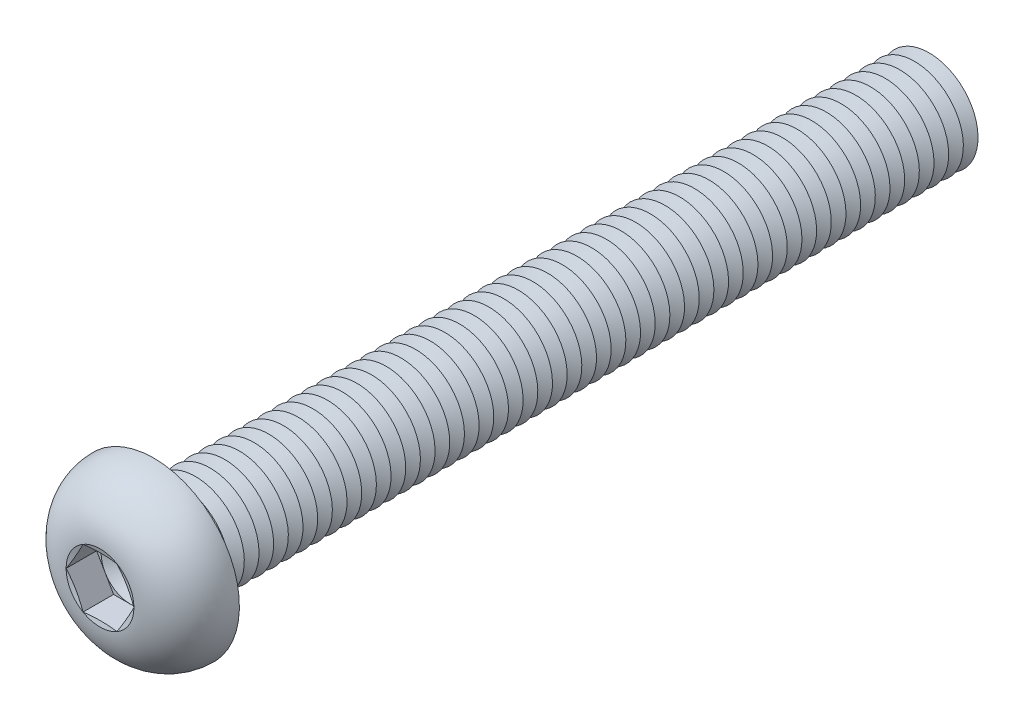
ISO-10303-21;
HEADER;
FILE_DESCRIPTION(('STEP AP214'),'2;1');
FILE_NAME('part.step','',(''),(''),'','','');
FILE_SCHEMA(('AUTOMOTIVE_DESIGN { 1 0 10303 214 1 1 1 1 }'));
ENDSEC;
DATA;
#1=APPLICATION_CONTEXT('core data for automotive mechanical design processes');
#2=APPLICATION_PROTOCOL_DEFINITION('international standard','automotive_design',2000,#1);
#3=PRODUCT_CONTEXT('',#1,'mechanical');
#4=PRODUCT('Part','Part','',(#3));
#5=PRODUCT_RELATED_PRODUCT_CATEGORY('part','',(#4));
#6=PRODUCT_DEFINITION_FORMATION('','',#4);
#7=PRODUCT_DEFINITION_CONTEXT('part definition',#1,'design');
#8=PRODUCT_DEFINITION('design','',#6,#7);
#9=PRODUCT_DEFINITION_SHAPE('','',#8);
#10=(LENGTH_UNIT() NAMED_UNIT(*) SI_UNIT(.MILLI.,.METRE.));
#11=(NAMED_UNIT(*) PLANE_ANGLE_UNIT() SI_UNIT($,.RADIAN.));
#12=(NAMED_UNIT(*) SI_UNIT($,.STERADIAN.) SOLID_ANGLE_UNIT());
#13=UNCERTAINTY_MEASURE_WITH_UNIT(LENGTH_MEASURE(1.E-05),#10,'distance_accuracy_value','');
#14=(GEOMETRIC_REPRESENTATION_CONTEXT(3) GLOBAL_UNCERTAINTY_ASSIGNED_CONTEXT((#13)) GLOBAL_UNIT_ASSIGNED_CONTEXT((#10,
#11,#12)) REPRESENTATION_CONTEXT('',''));
#15=CARTESIAN_POINT('',(0.,0.,0.));
#16=DIRECTION('',(0.,0.,1.));
#17=DIRECTION('',(1.,0.,0.));
#18=AXIS2_PLACEMENT_3D('',#15,#16,#17);
#19=CARTESIAN_POINT('',(0.,0.,2.38));
#20=DIRECTION('',(0.,0.,1.));
#21=DIRECTION('',(1.,0.,0.));
#22=AXIS2_PLACEMENT_3D('',#19,#20,#21);
#23=PLANE('',#22);
#24=CARTESIAN_POINT('',(0.,0.,2.38));
#25=DIRECTION('',(0.,0.,1.));
#26=DIRECTION('',(1.,0.,0.));
#27=AXIS2_PLACEMENT_3D('',#24,#25,#26);
#28=CIRCLE('',#27,2.99999860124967);
#29=CARTESIAN_POINT('',(2.598075,1.49999930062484,2.38));
#30=VERTEX_POINT('',#29);
#31=CARTESIAN_POINT('',(0.,2.99999860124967,2.38));
#32=VERTEX_POINT('',#31);
#33=EDGE_CURVE('E118',#30,#32,#28,.T.);
#34=ORIENTED_EDGE('',*,*,#33,.F.);
#35=DIRECTION('',(-0.500000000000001,0.866025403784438,0.));
#36=VECTOR('',#35,1.);
#37=CARTESIAN_POINT('',(3.4641,0.,2.38));
#38=LINE('',#37,#36);
#39=CARTESIAN_POINT('',(1.73205,2.99999860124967,2.38));
#40=VERTEX_POINT('',#39);
#41=EDGE_CURVE('E125',#30,#40,#38,.T.);
#42=ORIENTED_EDGE('',*,*,#41,.T.);
#43=DIRECTION('',(-1.,0.,0.));
#44=VECTOR('',#43,1.);
#45=CARTESIAN_POINT('',(1.73205,2.99999860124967,2.38));
#46=LINE('',#45,#44);
#47=EDGE_CURVE('E136',#40,#32,#46,.T.);
#48=ORIENTED_EDGE('',*,*,#47,.T.);
#49=EDGE_LOOP('',(#34,#42,#48));
#50=FACE_BOUND('',#49,.T.);
#51=ADVANCED_FACE('F39',(#50),#23,.T.);
#52=CARTESIAN_POINT('',(0.,0.,2.38));
#53=DIRECTION('',(0.,0.,1.));
#54=DIRECTION('',(1.,0.,0.));
#55=AXIS2_PLACEMENT_3D('',#52,#53,#54);
#56=CIRCLE('',#55,2.99999860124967);
#57=CARTESIAN_POINT('',(-2.598075,1.49999930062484,2.38));
#58=VERTEX_POINT('',#57);
#59=EDGE_CURVE('E11',#32,#58,#56,.T.);
#60=ORIENTED_EDGE('',*,*,#59,.F.);
#61=CARTESIAN_POINT('',(-1.73205,2.99999860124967,2.38));
#62=VERTEX_POINT('',#61);
#63=EDGE_CURVE('E131',#32,#62,#46,.T.);
#64=ORIENTED_EDGE('',*,*,#63,.T.);
#65=DIRECTION('',(-0.5,-0.866025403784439,0.));
#66=VECTOR('',#65,1.);
#67=CARTESIAN_POINT('',(-1.73205,2.99999860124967,2.38));
#68=LINE('',#67,#66);
#69=EDGE_CURVE('E134',#62,#58,#68,.T.);
#70=ORIENTED_EDGE('',*,*,#69,.T.);
#71=EDGE_LOOP('',(#60,#64,#70));
#72=FACE_BOUND('',#71,.T.);
#73=ADVANCED_FACE('F130',(#72),#23,.T.);
#74=CARTESIAN_POINT('',(-2.598075,-1.49999930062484,2.38));
#75=VERTEX_POINT('',#74);
#76=EDGE_CURVE('E49',#58,#75,#56,.T.);
#77=ORIENTED_EDGE('',*,*,#76,.F.);
#78=CARTESIAN_POINT('',(-3.4641,0.,2.38));
#79=VERTEX_POINT('',#78);
#80=EDGE_CURVE('E143',#58,#79,#68,.T.);
#81=ORIENTED_EDGE('',*,*,#80,.T.);
#82=DIRECTION('',(0.5,-0.866025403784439,0.));
#83=VECTOR('',#82,1.);
#84=CARTESIAN_POINT('',(-3.4641,0.,2.38));
#85=LINE('',#84,#83);
#86=EDGE_CURVE('E151',#79,#75,#85,.T.);
#87=ORIENTED_EDGE('',*,*,#86,.T.);
#88=EDGE_LOOP('',(#77,#81,#87));
#89=FACE_BOUND('',#88,.T.);
#90=ADVANCED_FACE('F483',(#89),#23,.T.);
#91=CARTESIAN_POINT('',(0.,-2.99999860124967,2.38));
#92=VERTEX_POINT('',#91);
#93=EDGE_CURVE('E467',#75,#92,#56,.T.);
#94=ORIENTED_EDGE('',*,*,#93,.F.);
#95=CARTESIAN_POINT('',(-1.73205,-2.99999860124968,2.38));
#96=VERTEX_POINT('',#95);
#97=EDGE_CURVE('E150',#75,#96,#85,.T.);
#98=ORIENTED_EDGE('',*,*,#97,.T.);
#99=DIRECTION('',(1.,0.,0.));
#100=VECTOR('',#99,1.);
#101=CARTESIAN_POINT('',(-1.73205,-2.99999860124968,2.38));
#102=LINE('',#101,#100);
#103=EDGE_CURVE('E156',#96,#92,#102,.T.);
#104=ORIENTED_EDGE('',*,*,#103,.T.);
#105=EDGE_LOOP('',(#94,#98,#104));
#106=FACE_BOUND('',#105,.T.);
#107=ADVANCED_FACE('F478',(#106),#23,.T.);
#108=CARTESIAN_POINT('',(2.598075,-1.49999930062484,2.38));
#109=VERTEX_POINT('',#108);
#110=EDGE_CURVE('E56',#92,#109,#56,.T.);
#111=ORIENTED_EDGE('',*,*,#110,.F.);
#112=CARTESIAN_POINT('',(1.73205,-2.99999860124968,2.38));
#113=VERTEX_POINT('',#112);
#114=EDGE_CURVE('E155',#92,#113,#102,.T.);
#115=ORIENTED_EDGE('',*,*,#114,.T.);
#116=DIRECTION('',(0.5,0.866025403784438,0.));
#117=VECTOR('',#116,1.);
#118=CARTESIAN_POINT('',(1.73205,-2.99999860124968,2.38));
#119=LINE('',#118,#117);
#120=EDGE_CURVE('E161',#113,#109,#119,.T.);
#121=ORIENTED_EDGE('',*,*,#120,.T.);
#122=EDGE_LOOP('',(#111,#115,#121));
#123=FACE_BOUND('',#122,.T.);
#124=ADVANCED_FACE('F603',(#123),#23,.T.);
#125=CARTESIAN_POINT('',(0.,0.,5.50000000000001));
#126=DIRECTION('',(0.,0.,1.));
#127=DIRECTION('',(0.,-1.,0.));
#128=AXIS2_PLACEMENT_3D('',#125,#126,#127);
#129=CONICAL_SURFACE('',#128,3.4641,1.30899693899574);
#130=CARTESIAN_POINT('',(3.46421547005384,-0.000200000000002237,5.50003094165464));
#131=CARTESIAN_POINT('',(3.39227822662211,0.124398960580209,5.48074619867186));
#132=CARTESIAN_POINT('',(3.32021054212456,0.249223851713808,5.46323875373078));
#133=CARTESIAN_POINT('',(3.17582062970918,0.499314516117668,5.43247971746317));
#134=CARTESIAN_POINT('',(3.10349831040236,0.624580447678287,5.41922985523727));
#135=CARTESIAN_POINT('',(2.95903767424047,0.874793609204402,5.39775958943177));
#136=CARTESIAN_POINT('',(2.88690033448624,0.999739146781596,5.38951357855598));
#137=CARTESIAN_POINT('',(2.74253364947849,1.2497895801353,5.37845651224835));
#138=CARTESIAN_POINT('',(2.67030432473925,1.37489444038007,5.3756444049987));
#139=CARTESIAN_POINT('',(2.52584567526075,1.6251041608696,5.3756444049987));
#140=CARTESIAN_POINT('',(2.45361635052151,1.75020902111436,5.37845651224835));
#141=CARTESIAN_POINT('',(2.30924966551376,2.00025945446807,5.38951357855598));
#142=CARTESIAN_POINT('',(2.23711232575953,2.12520499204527,5.39775958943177));
#143=CARTESIAN_POINT('',(2.09265168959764,2.37541815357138,5.41922985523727));
#144=CARTESIAN_POINT('',(2.02032937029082,2.500684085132,5.43247971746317));
#145=CARTESIAN_POINT('',(1.87593945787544,2.75077474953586,5.46323875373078));
#146=CARTESIAN_POINT('',(1.80387177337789,2.87559964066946,5.48074619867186));
#147=CARTESIAN_POINT('',(1.73193452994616,3.00019860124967,5.50003094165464));
#148=B_SPLINE_CURVE_WITH_KNOTS('',3,(#130,#131,#132,#133,#134,#135,#136,#137,#138,#139,#140,
#141,#142,#143,#144,#145,#146,#147),.UNSPECIFIED.,.F.,.F.,(4,2,2,2,2,2,2,2,4),(0.,
0.435506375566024,0.871189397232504,1.3046235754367,1.7379738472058,2.1713241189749,
2.6047582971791,3.04044131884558,3.4759476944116),.UNSPECIFIED.);
#149=CARTESIAN_POINT('',(3.4641,0.,5.5));
#150=VERTEX_POINT('',#149);
#151=CARTESIAN_POINT('',(1.73204999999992,2.99999860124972,5.50000000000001));
#152=VERTEX_POINT('',#151);
#153=EDGE_CURVE('E228',#150,#152,#148,.T.);
#154=ORIENTED_EDGE('',*,*,#153,.F.);
#155=CARTESIAN_POINT('',(0.,0.,5.50000000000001));
#156=DIRECTION('',(0.,0.,-1.));
#157=DIRECTION('',(0.,1.,0.));
#158=AXIS2_PLACEMENT_3D('',#155,#156,#157);
#159=CIRCLE('',#158,3.4641);
#160=EDGE_CURVE('E308',#152,#150,#159,.T.);
#161=ORIENTED_EDGE('',*,*,#160,.F.);
#162=EDGE_LOOP('',(#154,#161));
#163=FACE_BOUND('',#162,.T.);
#164=ADVANCED_FACE('F499',(#163),#129,.F.);
#165=CARTESIAN_POINT('',(1.73193452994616,-3.00019860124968,5.50003094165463));
#166=CARTESIAN_POINT('',(1.80387177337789,-2.87559964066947,5.48074619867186));
#167=CARTESIAN_POINT('',(1.87593945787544,-2.75077474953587,5.46323875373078));
#168=CARTESIAN_POINT('',(2.02032937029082,-2.50068408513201,5.43247971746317));
#169=CARTESIAN_POINT('',(2.09265168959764,-2.37541815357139,5.41922985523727));
#170=CARTESIAN_POINT('',(2.23711232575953,-2.12520499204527,5.39775958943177));
#171=CARTESIAN_POINT('',(2.30924966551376,-2.00025945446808,5.38951357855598));
#172=CARTESIAN_POINT('',(2.45361635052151,-1.75020902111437,5.37845651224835));
#173=CARTESIAN_POINT('',(2.52584567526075,-1.6251041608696,5.3756444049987));
#174=CARTESIAN_POINT('',(2.67030432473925,-1.37489444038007,5.3756444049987));
#175=CARTESIAN_POINT('',(2.74253364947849,-1.24978958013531,5.37845651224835));
#176=CARTESIAN_POINT('',(2.88690033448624,-0.999739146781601,5.38951357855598));
#177=CARTESIAN_POINT('',(2.95903767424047,-0.874793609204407,5.39775958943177));
#178=CARTESIAN_POINT('',(3.10349831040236,-0.624580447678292,5.41922985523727));
#179=CARTESIAN_POINT('',(3.17582062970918,-0.499314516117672,5.43247971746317));
#180=CARTESIAN_POINT('',(3.32021054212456,-0.249223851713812,5.46323875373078));
#181=CARTESIAN_POINT('',(3.39227822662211,-0.124398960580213,5.48074619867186));
#182=CARTESIAN_POINT('',(3.46421547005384,0.00019999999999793,5.50003094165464));
#183=B_SPLINE_CURVE_WITH_KNOTS('',3,(#165,#166,#167,#168,#169,#170,#171,#172,#173,#174,#175,
#176,#177,#178,#179,#180,#181,#182),.UNSPECIFIED.,.F.,.F.,(4,2,2,2,2,2,2,2,4),(0.,
0.435506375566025,0.871189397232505,1.3046235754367,1.7379738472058,2.1713241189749,
2.6047582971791,3.04044131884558,3.4759476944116),.UNSPECIFIED.);
#184=CARTESIAN_POINT('',(1.73205,-2.99999860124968,5.5));
#185=VERTEX_POINT('',#184);
#186=EDGE_CURVE('E231',#185,#150,#183,.T.);
#187=ORIENTED_EDGE('',*,*,#186,.F.);
#188=EDGE_CURVE('E291',#150,#185,#159,.T.);
#189=ORIENTED_EDGE('',*,*,#188,.F.);
#190=EDGE_LOOP('',(#187,#189));
#191=FACE_BOUND('',#190,.T.);
#192=ADVANCED_FACE('F289',(#191),#129,.F.);
#193=CARTESIAN_POINT('',(-5.2273006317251,-2.99999860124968,6.18672552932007));
#194=CARTESIAN_POINT('',(-5.10075887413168,-2.99999860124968,6.15732018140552));
#195=CARTESIAN_POINT('',(-4.97415993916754,-2.99999860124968,6.12816064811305));
#196=CARTESIAN_POINT('',(-4.72082394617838,-2.99999860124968,6.07043857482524));
#197=CARTESIAN_POINT('',(-4.59408688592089,-2.99999860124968,6.04187604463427));
#198=CARTESIAN_POINT('',(-4.21358997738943,-2.99999860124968,5.95723252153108));
#199=CARTESIAN_POINT('',(-3.95959339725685,-2.99999860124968,5.90220706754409));
#200=CARTESIAN_POINT('',(-3.44835573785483,-2.99999860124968,5.79574115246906));
#201=CARTESIAN_POINT('',(-3.19110656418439,-2.99999860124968,5.74433913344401));
#202=CARTESIAN_POINT('',(-2.67540790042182,-2.99999860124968,5.6477299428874));
#203=CARTESIAN_POINT('',(-2.41695830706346,-2.99999860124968,5.60252331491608));
#204=CARTESIAN_POINT('',(-1.9055512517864,-2.99999860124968,5.52251897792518));
#205=CARTESIAN_POINT('',(-1.65263426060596,-2.99999860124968,5.48747285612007));
#206=CARTESIAN_POINT('',(-1.27220564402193,-2.99999860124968,5.4443960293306));
#207=CARTESIAN_POINT('',(-1.1452320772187,-2.99999860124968,5.43161987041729));
#208=CARTESIAN_POINT('',(-0.890973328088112,-2.99999860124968,5.40972605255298));
#209=CARTESIAN_POINT('',(-0.76368816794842,-2.99999860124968,5.40060814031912));
#210=CARTESIAN_POINT('',(-0.50944206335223,-2.99999860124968,5.38647457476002));
#211=CARTESIAN_POINT('',(-0.382482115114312,-2.99999860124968,5.38144125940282));
#212=CARTESIAN_POINT('',(-0.128463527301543,-2.99999860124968,5.37566637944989));
#213=CARTESIAN_POINT('',(-0.00140488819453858,-2.99999860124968,5.37492479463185));
#214=CARTESIAN_POINT('',(0.252672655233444,-2.99999860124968,5.37777315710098));
#215=CARTESIAN_POINT('',(0.379691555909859,-2.99999860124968,5.38136342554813));
#216=CARTESIAN_POINT('',(0.633540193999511,-2.99999860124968,5.39268816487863));
#217=CARTESIAN_POINT('',(0.760369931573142,-2.99999860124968,5.40042263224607));
#218=CARTESIAN_POINT('',(1.06836981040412,-2.99999860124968,5.42382465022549));
#219=CARTESIAN_POINT('',(1.24938929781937,-2.99999860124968,5.44147485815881));
#220=CARTESIAN_POINT('',(1.61066786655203,-2.99999860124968,5.48312309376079));
#221=CARTESIAN_POINT('',(1.7909269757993,-2.99999860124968,5.50712088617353));
#222=CARTESIAN_POINT('',(2.15127612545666,-2.99999860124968,5.56013471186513));
#223=CARTESIAN_POINT('',(2.33136383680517,-2.99999860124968,5.58916634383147));
#224=CARTESIAN_POINT('',(2.690892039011,-2.99999860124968,5.65100028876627));
#225=CARTESIAN_POINT('',(2.87033249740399,-2.99999860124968,5.68380278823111));
#226=CARTESIAN_POINT('',(3.23235399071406,-2.99999860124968,5.75295369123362));
#227=CARTESIAN_POINT('',(3.4149236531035,-2.99999860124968,5.78936117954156));
#228=CARTESIAN_POINT('',(3.77960351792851,-2.99999860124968,5.86440648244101));
#229=CARTESIAN_POINT('',(3.96171371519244,-2.99999860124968,5.90304432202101));
#230=CARTESIAN_POINT('',(4.32457472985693,-2.99999860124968,5.98179660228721));
#231=CARTESIAN_POINT('',(4.5053275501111,-2.99999860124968,6.02190185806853));
#232=CARTESIAN_POINT('',(4.86652484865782,-2.99999860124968,6.10342152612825));
#233=CARTESIAN_POINT('',(5.04696934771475,-2.99999860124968,6.14483584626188));
#234=CARTESIAN_POINT('',(5.22730063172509,-2.99999860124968,6.18672552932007));
#235=B_SPLINE_CURVE_WITH_KNOTS('',3,(#193,#194,#195,#196,#197,#198,#199,#200,#201,#202,#203,
#204,#205,#206,#207,#208,#209,#210,#211,#212,#213,#214,#215,#216,#217,#218,#219,#220,#221,#222,
#223,#224,#225,#226,#227,#228,#229,#230,#231,#232,#233,#234),.UNSPECIFIED.,.F.,.F.,(4,2,2,2,2,2,
2,2,2,2,2,2,2,2,2,2,2,2,2,2,4),(0.,0.389739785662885,0.779485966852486,1.5591292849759,
2.34608117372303,3.13310206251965,3.8988410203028,4.28164148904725,4.66441544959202,
5.04552531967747,5.42663339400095,5.80776972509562,6.18890573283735,6.73438998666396,
7.27985402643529,7.8270395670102,8.37425218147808,8.93272720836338,9.49120849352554,
10.0466490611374,10.6020506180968),.UNSPECIFIED.);
#236=CARTESIAN_POINT('',(-1.73205,-2.99999860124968,5.5));
#237=VERTEX_POINT('',#236);
#238=EDGE_CURVE('E241',#237,#185,#235,.T.);
#239=ORIENTED_EDGE('',*,*,#238,.F.);
#240=EDGE_CURVE('E296',#185,#237,#159,.T.);
#241=ORIENTED_EDGE('',*,*,#240,.F.);
#242=EDGE_LOOP('',(#239,#241));
#243=FACE_BOUND('',#242,.T.);
#244=ADVANCED_FACE('F297',(#243),#129,.F.);
#245=CARTESIAN_POINT('',(-3.46421547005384,0.00019999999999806,5.50003094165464));
#246=CARTESIAN_POINT('',(-3.39227822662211,-0.124398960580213,5.48074619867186));
#247=CARTESIAN_POINT('',(-3.32021054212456,-0.249223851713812,5.46323875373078));
#248=CARTESIAN_POINT('',(-3.17582062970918,-0.499314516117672,5.43247971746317));
#249=CARTESIAN_POINT('',(-3.10349831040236,-0.624580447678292,5.41922985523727));
#250=CARTESIAN_POINT('',(-2.95903767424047,-0.874793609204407,5.39775958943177));
#251=CARTESIAN_POINT('',(-2.88690033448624,-0.999739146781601,5.38951357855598));
#252=CARTESIAN_POINT('',(-2.74253364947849,-1.24978958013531,5.37845651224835));
#253=CARTESIAN_POINT('',(-2.67030432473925,-1.37489444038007,5.3756444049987));
#254=CARTESIAN_POINT('',(-2.52584567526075,-1.6251041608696,5.3756444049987));
#255=CARTESIAN_POINT('',(-2.45361635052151,-1.75020902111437,5.37845651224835));
#256=CARTESIAN_POINT('',(-2.30924966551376,-2.00025945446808,5.38951357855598));
#257=CARTESIAN_POINT('',(-2.23711232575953,-2.12520499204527,5.39775958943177));
#258=CARTESIAN_POINT('',(-2.09265168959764,-2.37541815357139,5.41922985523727));
#259=CARTESIAN_POINT('',(-2.02032937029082,-2.50068408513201,5.43247971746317));
#260=CARTESIAN_POINT('',(-1.87593945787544,-2.75077474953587,5.46323875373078));
#261=CARTESIAN_POINT('',(-1.80387177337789,-2.87559964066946,5.48074619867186));
#262=CARTESIAN_POINT('',(-1.73193452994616,-3.00019860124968,5.50003094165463));
#263=B_SPLINE_CURVE_WITH_KNOTS('',3,(#245,#246,#247,#248,#249,#250,#251,#252,#253,#254,#255,
#256,#257,#258,#259,#260,#261,#262),.UNSPECIFIED.,.F.,.F.,(4,2,2,2,2,2,2,2,4),(0.,
0.435506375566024,0.871189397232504,1.3046235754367,1.7379738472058,2.1713241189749,
2.6047582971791,3.04044131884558,3.4759476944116),.UNSPECIFIED.);
#264=CARTESIAN_POINT('',(-3.4641,0.,5.5));
#265=VERTEX_POINT('',#264);
#266=EDGE_CURVE('E236',#265,#237,#263,.T.);
#267=ORIENTED_EDGE('',*,*,#266,.F.);
#268=EDGE_CURVE('E302',#237,#265,#159,.T.);
#269=ORIENTED_EDGE('',*,*,#268,.F.);
#270=EDGE_LOOP('',(#267,#269));
#271=FACE_BOUND('',#270,.T.);
#272=ADVANCED_FACE('F490',(#271),#129,.F.);
#273=CARTESIAN_POINT('',(-1.73193452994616,3.00019860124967,5.50003094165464));
#274=CARTESIAN_POINT('',(-1.8038717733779,2.87559964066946,5.48074619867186));
#275=CARTESIAN_POINT('',(-1.87593945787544,2.75077474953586,5.46323875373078));
#276=CARTESIAN_POINT('',(-2.02032937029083,2.500684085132,5.43247971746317));
#277=CARTESIAN_POINT('',(-2.09265168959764,2.37541815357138,5.41922985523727));
#278=CARTESIAN_POINT('',(-2.23711232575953,2.12520499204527,5.39775958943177));
#279=CARTESIAN_POINT('',(-2.30924966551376,2.00025945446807,5.38951357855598));
#280=CARTESIAN_POINT('',(-2.45361635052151,1.75020902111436,5.37845651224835));
#281=CARTESIAN_POINT('',(-2.52584567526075,1.6251041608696,5.3756444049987));
#282=CARTESIAN_POINT('',(-2.67030432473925,1.37489444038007,5.3756444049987));
#283=CARTESIAN_POINT('',(-2.74253364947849,1.2497895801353,5.37845651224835));
#284=CARTESIAN_POINT('',(-2.88690033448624,0.999739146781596,5.38951357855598));
#285=CARTESIAN_POINT('',(-2.95903767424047,0.874793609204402,5.39775958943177));
#286=CARTESIAN_POINT('',(-3.10349831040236,0.624580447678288,5.41922985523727));
#287=CARTESIAN_POINT('',(-3.17582062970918,0.499314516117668,5.43247971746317));
#288=CARTESIAN_POINT('',(-3.32021054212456,0.249223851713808,5.46323875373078));
#289=CARTESIAN_POINT('',(-3.39227822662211,0.124398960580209,5.48074619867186));
#290=CARTESIAN_POINT('',(-3.46421547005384,-0.000200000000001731,5.50003094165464));
#291=B_SPLINE_CURVE_WITH_KNOTS('',3,(#273,#274,#275,#276,#277,#278,#279,#280,#281,#282,#283,
#284,#285,#286,#287,#288,#289,#290),.UNSPECIFIED.,.F.,.F.,(4,2,2,2,2,2,2,2,4),(0.,
0.435506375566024,0.871189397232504,1.3046235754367,1.7379738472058,2.1713241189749,
2.6047582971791,3.04044131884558,3.4759476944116),.UNSPECIFIED.);
#292=CARTESIAN_POINT('',(-1.73205,2.99999860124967,5.5));
#293=VERTEX_POINT('',#292);
#294=EDGE_CURVE('E233',#293,#265,#291,.T.);
#295=ORIENTED_EDGE('',*,*,#294,.F.);
#296=EDGE_CURVE('E320',#265,#293,#159,.T.);
#297=ORIENTED_EDGE('',*,*,#296,.F.);
#298=EDGE_LOOP('',(#295,#297));
#299=FACE_BOUND('',#298,.T.);
#300=ADVANCED_FACE('F493',(#299),#129,.F.);
#301=CARTESIAN_POINT('',(0.,0.,-74.75));
#302=DIRECTION('',(0.,0.,1.));
#303=DIRECTION('',(0.,-1.,0.));
#304=AXIS2_PLACEMENT_3D('',#301,#302,#303);
#305=CONICAL_SURFACE('',#304,4.99999999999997,1.0471975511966);
#306=CARTESIAN_POINT('',(0.,0.,-75.5));
#307=DIRECTION('',(0.,0.,1.));
#308=DIRECTION('',(0.,-1.,0.));
#309=AXIS2_PLACEMENT_3D('',#306,#307,#308);
#310=CIRCLE('',#309,3.70096189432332);
#311=CARTESIAN_POINT('',(0.,-3.70096189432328,-75.5));
#312=VERTEX_POINT('',#311);
#313=EDGE_CURVE('E428',#312,#312,#310,.T.);
#314=ORIENTED_EDGE('',*,*,#313,.T.);
#315=EDGE_LOOP('',(#314));
#316=FACE_BOUND('',#315,.T.);
#317=CARTESIAN_POINT('',(0.,0.,-74.75));
#318=DIRECTION('',(0.,0.,1.));
#319=DIRECTION('',(0.,-1.,0.));
#320=AXIS2_PLACEMENT_3D('',#317,#318,#319);
#321=CIRCLE('',#320,4.99999999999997);
#322=CARTESIAN_POINT('',(0.,-4.99999999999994,-74.75));
#323=VERTEX_POINT('',#322);
#324=EDGE_CURVE('E424',#323,#323,#321,.T.);
#325=ORIENTED_EDGE('',*,*,#324,.F.);
#326=EDGE_LOOP('',(#325));
#327=FACE_BOUND('',#326,.T.);
#328=ADVANCED_FACE('F1512',(#316,#327),#305,.T.);
#329=CARTESIAN_POINT('',(0.,0.,-75.5));
#330=DIRECTION('',(0.,0.,-1.));
#331=DIRECTION('',(0.,1.,0.));
#332=AXIS2_PLACEMENT_3D('',#329,#330,#331);
#333=CONICAL_SURFACE('',#332,3.70096189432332,1.0471975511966);
#334=CARTESIAN_POINT('',(0.,0.,-76.25));
#335=DIRECTION('',(0.,0.,1.));
#336=DIRECTION('',(0.,-1.,0.));
#337=AXIS2_PLACEMENT_3D('',#334,#335,#336);
#338=CIRCLE('',#337,4.99999999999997);
#339=CARTESIAN_POINT('',(0.,-4.99999999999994,-76.25));
#340=VERTEX_POINT('',#339);
#341=EDGE_CURVE('E431',#340,#340,#338,.T.);
#342=ORIENTED_EDGE('',*,*,#341,.T.);
#343=EDGE_LOOP('',(#342));
#344=FACE_BOUND('',#343,.T.);
#345=ORIENTED_EDGE('',*,*,#313,.F.);
#346=EDGE_LOOP('',(#345));
#347=FACE_BOUND('',#346,.T.);
#348=ADVANCED_FACE('F1930',(#344,#347),#333,.T.);
#349=CARTESIAN_POINT('',(0.,4.99999999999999,-80.));
#350=DIRECTION('',(0.,0.,-1.));
#351=DIRECTION('',(0.,1.,0.));
#352=AXIS2_PLACEMENT_3D('',#349,#350,#351);
#353=PLANE('',#352);
#354=CARTESIAN_POINT('',(0.,0.,-80.));
#355=DIRECTION('',(0.,0.,1.));
#356=DIRECTION('',(0.,-1.,0.));
#357=AXIS2_PLACEMENT_3D('',#354,#355,#356);
#358=CIRCLE('',#357,3.70096189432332);
#359=CARTESIAN_POINT('',(0.,-3.70096189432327,-80.));
#360=VERTEX_POINT('',#359);
#361=EDGE_CURVE('E327',#360,#360,#358,.T.);
#362=ORIENTED_EDGE('',*,*,#361,.F.);
#363=EDGE_LOOP('',(#362));
#364=FACE_BOUND('',#363,.T.);
#365=ADVANCED_FACE('F1935',(#364),#353,.T.);
#366=CARTESIAN_POINT('',(0.,0.,-79.25));
#367=DIRECTION('',(0.,0.,1.));
#368=DIRECTION('',(0.,-1.,0.));
#369=AXIS2_PLACEMENT_3D('',#366,#367,#368);
#370=CONICAL_SURFACE('',#369,4.99999999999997,1.0471975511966);
#371=ORIENTED_EDGE('',*,*,#361,.T.);
#372=EDGE_LOOP('',(#371));
#373=FACE_BOUND('',#372,.T.);
#374=CARTESIAN_POINT('',(0.,0.,-79.25));
#375=DIRECTION('',(0.,0.,1.));
#376=DIRECTION('',(0.,-1.,0.));
#377=AXIS2_PLACEMENT_3D('',#374,#375,#376);
#378=CIRCLE('',#377,4.99999999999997);
#379=CARTESIAN_POINT('',(0.,-4.99999999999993,-79.25));
#380=VERTEX_POINT('',#379);
#381=EDGE_CURVE('E447',#380,#380,#378,.T.);
#382=ORIENTED_EDGE('',*,*,#381,.F.);
#383=EDGE_LOOP('',(#382));
#384=FACE_BOUND('',#383,.T.);
#385=ADVANCED_FACE('F1924',(#373,#384),#370,.T.);
#386=CARTESIAN_POINT('',(0.,0.,-78.5));
#387=DIRECTION('',(0.,0.,-1.));
#388=DIRECTION('',(0.,1.,0.));
#389=AXIS2_PLACEMENT_3D('',#386,#387,#388);
#390=CONICAL_SURFACE('',#389,3.70096189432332,1.0471975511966);
#391=ORIENTED_EDGE('',*,*,#381,.T.);
#392=EDGE_LOOP('',(#391));
#393=FACE_BOUND('',#392,.T.);
#394=CARTESIAN_POINT('',(0.,0.,-78.5));
#395=DIRECTION('',(0.,0.,1.));
#396=DIRECTION('',(0.,-1.,0.));
#397=AXIS2_PLACEMENT_3D('',#394,#395,#396);
#398=CIRCLE('',#397,3.70096189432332);
#399=CARTESIAN_POINT('',(0.,-3.70096189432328,-78.5));
#400=VERTEX_POINT('',#399);
#401=EDGE_CURVE('E443',#400,#400,#398,.T.);
#402=ORIENTED_EDGE('',*,*,#401,.F.);
#403=EDGE_LOOP('',(#402));
#404=FACE_BOUND('',#403,.T.);
#405=ADVANCED_FACE('F1914',(#393,#404),#390,.T.);
#406=CARTESIAN_POINT('',(0.,0.,-77.75));
#407=DIRECTION('',(0.,0.,1.));
#408=DIRECTION('',(0.,-1.,0.));
#409=AXIS2_PLACEMENT_3D('',#406,#407,#408);
#410=CONICAL_SURFACE('',#409,4.99999999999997,1.0471975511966);
#411=ORIENTED_EDGE('',*,*,#401,.T.);
#412=EDGE_LOOP('',(#411));
#413=FACE_BOUND('',#412,.T.);
#414=CARTESIAN_POINT('',(0.,0.,-77.75));
#415=DIRECTION('',(0.,0.,1.));
#416=DIRECTION('',(0.,-1.,0.));
#417=AXIS2_PLACEMENT_3D('',#414,#415,#416);
#418=CIRCLE('',#417,4.99999999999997);
#419=CARTESIAN_POINT('',(0.,-4.99999999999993,-77.75));
#420=VERTEX_POINT('',#419);
#421=EDGE_CURVE('E439',#420,#420,#418,.T.);
#422=ORIENTED_EDGE('',*,*,#421,.F.);
#423=EDGE_LOOP('',(#422));
#424=FACE_BOUND('',#423,.T.);
#425=ADVANCED_FACE('F1904',(#413,#424),#410,.T.);
#426=CARTESIAN_POINT('',(0.,0.,-77.));
#427=DIRECTION('',(0.,0.,-1.));
#428=DIRECTION('',(0.,1.,0.));
#429=AXIS2_PLACEMENT_3D('',#426,#427,#428);
#430=CONICAL_SURFACE('',#429,3.70096189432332,1.0471975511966);
#431=ORIENTED_EDGE('',*,*,#421,.T.);
#432=EDGE_LOOP('',(#431));
#433=FACE_BOUND('',#432,.T.);
#434=CARTESIAN_POINT('',(0.,0.,-77.));
#435=DIRECTION('',(0.,0.,1.));
#436=DIRECTION('',(0.,-1.,0.));
#437=AXIS2_PLACEMENT_3D('',#434,#435,#436);
#438=CIRCLE('',#437,3.70096189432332);
#439=CARTESIAN_POINT('',(0.,-3.70096189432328,-77.));
#440=VERTEX_POINT('',#439);
#441=EDGE_CURVE('E435',#440,#440,#438,.T.);
#442=ORIENTED_EDGE('',*,*,#441,.F.);
#443=EDGE_LOOP('',(#442));
#444=FACE_BOUND('',#443,.T.);
#445=ADVANCED_FACE('F1894',(#433,#444),#430,.T.);
#446=CARTESIAN_POINT('',(0.,0.,-76.25));
#447=DIRECTION('',(0.,0.,1.));
#448=DIRECTION('',(0.,-1.,0.));
#449=AXIS2_PLACEMENT_3D('',#446,#447,#448);
#450=CONICAL_SURFACE('',#449,4.99999999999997,1.0471975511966);
#451=ORIENTED_EDGE('',*,*,#441,.T.);
#452=EDGE_LOOP('',(#451));
#453=FACE_BOUND('',#452,.T.);
#454=ORIENTED_EDGE('',*,*,#341,.F.);
#455=EDGE_LOOP('',(#454));
#456=FACE_BOUND('',#455,.T.);
#457=ADVANCED_FACE('F1884',(#453,#456),#450,.T.);
#458=CARTESIAN_POINT('',(0.,0.,-73.25));
#459=DIRECTION('',(0.,0.,1.));
#460=DIRECTION('',(0.,-1.,0.));
#461=AXIS2_PLACEMENT_3D('',#458,#459,#460);
#462=CONICAL_SURFACE('',#461,4.99999999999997,1.0471975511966);
#463=CARTESIAN_POINT('',(0.,0.,-74.));
#464=DIRECTION('',(0.,0.,1.));
#465=DIRECTION('',(0.,-1.,0.));
#466=AXIS2_PLACEMENT_3D('',#463,#464,#465);
#467=CIRCLE('',#466,3.70096189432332);
#468=CARTESIAN_POINT('',(0.,-3.70096189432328,-74.));
#469=VERTEX_POINT('',#468);
#470=EDGE_CURVE('E420',#469,#469,#467,.T.);
#471=ORIENTED_EDGE('',*,*,#470,.T.);
#472=EDGE_LOOP('',(#471));
#473=FACE_BOUND('',#472,.T.);
#474=CARTESIAN_POINT('',(0.,0.,-73.25));
#475=DIRECTION('',(0.,0.,1.));
#476=DIRECTION('',(0.,-1.,0.));
#477=AXIS2_PLACEMENT_3D('',#474,#475,#476);
#478=CIRCLE('',#477,4.99999999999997);
#479=CARTESIAN_POINT('',(0.,-4.99999999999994,-73.25));
#480=VERTEX_POINT('',#479);
#481=EDGE_CURVE('E416',#480,#480,#478,.T.);
#482=ORIENTED_EDGE('',*,*,#481,.F.);
#483=EDGE_LOOP('',(#482));
#484=FACE_BOUND('',#483,.T.);
#485=ADVANCED_FACE('F1874',(#473,#484),#462,.T.);
#486=CARTESIAN_POINT('',(0.,0.,-74.));
#487=DIRECTION('',(0.,0.,-1.));
#488=DIRECTION('',(0.,1.,0.));
#489=AXIS2_PLACEMENT_3D('',#486,#487,#488);
#490=CONICAL_SURFACE('',#489,3.70096189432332,1.0471975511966);
#491=ORIENTED_EDGE('',*,*,#324,.T.);
#492=EDGE_LOOP('',(#491));
#493=FACE_BOUND('',#492,.T.);
#494=ORIENTED_EDGE('',*,*,#470,.F.);
#495=EDGE_LOOP('',(#494));
#496=FACE_BOUND('',#495,.T.);
#497=ADVANCED_FACE('F1864',(#493,#496),#490,.T.);
#498=CARTESIAN_POINT('',(0.,0.,-71.75));
#499=DIRECTION('',(0.,0.,1.));
#500=DIRECTION('',(0.,-1.,0.));
#501=AXIS2_PLACEMENT_3D('',#498,#499,#500);
#502=CONICAL_SURFACE('',#501,4.99999999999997,1.0471975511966);
#503=CARTESIAN_POINT('',(0.,0.,-72.5));
#504=DIRECTION('',(0.,0.,1.));
#505=DIRECTION('',(0.,-1.,0.));
#506=AXIS2_PLACEMENT_3D('',#503,#504,#505);
#507=CIRCLE('',#506,3.70096189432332);
#508=CARTESIAN_POINT('',(0.,-3.70096189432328,-72.5));
#509=VERTEX_POINT('',#508);
#510=EDGE_CURVE('E412',#509,#509,#507,.T.);
#511=ORIENTED_EDGE('',*,*,#510,.T.);
#512=EDGE_LOOP('',(#511));
#513=FACE_BOUND('',#512,.T.);
#514=CARTESIAN_POINT('',(0.,0.,-71.75));
#515=DIRECTION('',(0.,0.,1.));
#516=DIRECTION('',(0.,-1.,0.));
#517=AXIS2_PLACEMENT_3D('',#514,#515,#516);
#518=CIRCLE('',#517,4.99999999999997);
#519=CARTESIAN_POINT('',(0.,-4.99999999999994,-71.75));
#520=VERTEX_POINT('',#519);
#521=EDGE_CURVE('E408',#520,#520,#518,.T.);
#522=ORIENTED_EDGE('',*,*,#521,.F.);
#523=EDGE_LOOP('',(#522));
#524=FACE_BOUND('',#523,.T.);
#525=ADVANCED_FACE('F1854',(#513,#524),#502,.T.);
#526=CARTESIAN_POINT('',(0.,0.,-72.5));
#527=DIRECTION('',(0.,0.,-1.));
#528=DIRECTION('',(0.,1.,0.));
#529=AXIS2_PLACEMENT_3D('',#526,#527,#528);
#530=CONICAL_SURFACE('',#529,3.70096189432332,1.0471975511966);
#531=ORIENTED_EDGE('',*,*,#481,.T.);
#532=EDGE_LOOP('',(#531));
#533=FACE_BOUND('',#532,.T.);
#534=ORIENTED_EDGE('',*,*,#510,.F.);
#535=EDGE_LOOP('',(#534));
#536=FACE_BOUND('',#535,.T.);
#537=ADVANCED_FACE('F1844',(#533,#536),#530,.T.);
#538=CARTESIAN_POINT('',(0.,0.,-70.25));
#539=DIRECTION('',(0.,0.,1.));
#540=DIRECTION('',(0.,-1.,0.));
#541=AXIS2_PLACEMENT_3D('',#538,#539,#540);
#542=CONICAL_SURFACE('',#541,4.99999999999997,1.0471975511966);
#543=CARTESIAN_POINT('',(0.,0.,-71.));
#544=DIRECTION('',(0.,0.,1.));
#545=DIRECTION('',(0.,-1.,0.));
#546=AXIS2_PLACEMENT_3D('',#543,#544,#545);
#547=CIRCLE('',#546,3.70096189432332);
#548=CARTESIAN_POINT('',(0.,-3.70096189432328,-71.));
#549=VERTEX_POINT('',#548);
#550=EDGE_CURVE('E404',#549,#549,#547,.T.);
#551=ORIENTED_EDGE('',*,*,#550,.T.);
#552=EDGE_LOOP('',(#551));
#553=FACE_BOUND('',#552,.T.);
#554=CARTESIAN_POINT('',(0.,0.,-70.25));
#555=DIRECTION('',(0.,0.,1.));
#556=DIRECTION('',(0.,-1.,0.));
#557=AXIS2_PLACEMENT_3D('',#554,#555,#556);
#558=CIRCLE('',#557,4.99999999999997);
#559=CARTESIAN_POINT('',(0.,-4.99999999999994,-70.25));
#560=VERTEX_POINT('',#559);
#561=EDGE_CURVE('E400',#560,#560,#558,.T.);
#562=ORIENTED_EDGE('',*,*,#561,.F.);
#563=EDGE_LOOP('',(#562));
#564=FACE_BOUND('',#563,.T.);
#565=ADVANCED_FACE('F1834',(#553,#564),#542,.T.);
#566=CARTESIAN_POINT('',(0.,0.,-71.));
#567=DIRECTION('',(0.,0.,-1.));
#568=DIRECTION('',(0.,1.,0.));
#569=AXIS2_PLACEMENT_3D('',#566,#567,#568);
#570=CONICAL_SURFACE('',#569,3.70096189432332,1.0471975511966);
#571=ORIENTED_EDGE('',*,*,#521,.T.);
#572=EDGE_LOOP('',(#571));
#573=FACE_BOUND('',#572,.T.);
#574=ORIENTED_EDGE('',*,*,#550,.F.);
#575=EDGE_LOOP('',(#574));
#576=FACE_BOUND('',#575,.T.);
#577=ADVANCED_FACE('F1824',(#573,#576),#570,.T.);
#578=CARTESIAN_POINT('',(0.,0.,-68.75));
#579=DIRECTION('',(0.,0.,1.));
#580=DIRECTION('',(0.,-1.,0.));
#581=AXIS2_PLACEMENT_3D('',#578,#579,#580);
#582=CONICAL_SURFACE('',#581,4.99999999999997,1.0471975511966);
#583=CARTESIAN_POINT('',(0.,0.,-69.5));
#584=DIRECTION('',(0.,0.,1.));
#585=DIRECTION('',(0.,-1.,0.));
#586=AXIS2_PLACEMENT_3D('',#583,#584,#585);
#587=CIRCLE('',#586,3.70096189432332);
#588=CARTESIAN_POINT('',(0.,-3.70096189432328,-69.5));
#589=VERTEX_POINT('',#588);
#590=EDGE_CURVE('E396',#589,#589,#587,.T.);
#591=ORIENTED_EDGE('',*,*,#590,.T.);
#592=EDGE_LOOP('',(#591));
#593=FACE_BOUND('',#592,.T.);
#594=CARTESIAN_POINT('',(0.,0.,-68.75));
#595=DIRECTION('',(0.,0.,1.));
#596=DIRECTION('',(0.,-1.,0.));
#597=AXIS2_PLACEMENT_3D('',#594,#595,#596);
#598=CIRCLE('',#597,4.99999999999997);
#599=CARTESIAN_POINT('',(0.,-4.99999999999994,-68.75));
#600=VERTEX_POINT('',#599);
#601=EDGE_CURVE('E392',#600,#600,#598,.T.);
#602=ORIENTED_EDGE('',*,*,#601,.F.);
#603=EDGE_LOOP('',(#602));
#604=FACE_BOUND('',#603,.T.);
#605=ADVANCED_FACE('F1814',(#593,#604),#582,.T.);
#606=CARTESIAN_POINT('',(0.,0.,-69.5));
#607=DIRECTION('',(0.,0.,-1.));
#608=DIRECTION('',(0.,1.,0.));
#609=AXIS2_PLACEMENT_3D('',#606,#607,#608);
#610=CONICAL_SURFACE('',#609,3.70096189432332,1.0471975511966);
#611=ORIENTED_EDGE('',*,*,#561,.T.);
#612=EDGE_LOOP('',(#611));
#613=FACE_BOUND('',#612,.T.);
#614=ORIENTED_EDGE('',*,*,#590,.F.);
#615=EDGE_LOOP('',(#614));
#616=FACE_BOUND('',#615,.T.);
#617=ADVANCED_FACE('F1804',(#613,#616),#610,.T.);
#618=CARTESIAN_POINT('',(0.,0.,-67.25));
#619=DIRECTION('',(0.,0.,1.));
#620=DIRECTION('',(0.,-1.,0.));
#621=AXIS2_PLACEMENT_3D('',#618,#619,#620);
#622=CONICAL_SURFACE('',#621,4.99999999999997,1.0471975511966);
#623=CARTESIAN_POINT('',(0.,0.,-68.));
#624=DIRECTION('',(0.,0.,1.));
#625=DIRECTION('',(0.,-1.,0.));
#626=AXIS2_PLACEMENT_3D('',#623,#624,#625);
#627=CIRCLE('',#626,3.70096189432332);
#628=CARTESIAN_POINT('',(0.,-3.70096189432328,-68.));
#629=VERTEX_POINT('',#628);
#630=EDGE_CURVE('E389',#629,#629,#627,.T.);
#631=ORIENTED_EDGE('',*,*,#630,.T.);
#632=EDGE_LOOP('',(#631));
#633=FACE_BOUND('',#632,.T.);
#634=CARTESIAN_POINT('',(0.,0.,-67.25));
#635=DIRECTION('',(0.,0.,1.));
#636=DIRECTION('',(0.,-1.,0.));
#637=AXIS2_PLACEMENT_3D('',#634,#635,#636);
#638=CIRCLE('',#637,4.99999999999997);
#639=CARTESIAN_POINT('',(0.,-4.99999999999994,-67.25));
#640=VERTEX_POINT('',#639);
#641=EDGE_CURVE('E385',#640,#640,#638,.T.);
#642=ORIENTED_EDGE('',*,*,#641,.F.);
#643=EDGE_LOOP('',(#642));
#644=FACE_BOUND('',#643,.T.);
#645=ADVANCED_FACE('F1794',(#633,#644),#622,.T.);
#646=CARTESIAN_POINT('',(0.,0.,-68.));
#647=DIRECTION('',(0.,0.,-1.));
#648=DIRECTION('',(0.,1.,0.));
#649=AXIS2_PLACEMENT_3D('',#646,#647,#648);
#650=CONICAL_SURFACE('',#649,3.70096189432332,1.0471975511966);
#651=ORIENTED_EDGE('',*,*,#601,.T.);
#652=EDGE_LOOP('',(#651));
#653=FACE_BOUND('',#652,.T.);
#654=ORIENTED_EDGE('',*,*,#630,.F.);
#655=EDGE_LOOP('',(#654));
#656=FACE_BOUND('',#655,.T.);
#657=ADVANCED_FACE('F1784',(#653,#656),#650,.T.);
#658=CARTESIAN_POINT('',(0.,0.,-65.75));
#659=DIRECTION('',(0.,0.,1.));
#660=DIRECTION('',(0.,-1.,0.));
#661=AXIS2_PLACEMENT_3D('',#658,#659,#660);
#662=CONICAL_SURFACE('',#661,4.99999999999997,1.0471975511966);
#663=CARTESIAN_POINT('',(0.,0.,-66.5));
#664=DIRECTION('',(0.,0.,1.));
#665=DIRECTION('',(0.,-1.,0.));
#666=AXIS2_PLACEMENT_3D('',#663,#664,#665);
#667=CIRCLE('',#666,3.70096189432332);
#668=CARTESIAN_POINT('',(0.,-3.70096189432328,-66.5));
#669=VERTEX_POINT('',#668);
#670=EDGE_CURVE('E381',#669,#669,#667,.T.);
#671=ORIENTED_EDGE('',*,*,#670,.T.);
#672=EDGE_LOOP('',(#671));
#673=FACE_BOUND('',#672,.T.);
#674=CARTESIAN_POINT('',(0.,0.,-65.75));
#675=DIRECTION('',(0.,0.,1.));
#676=DIRECTION('',(0.,-1.,0.));
#677=AXIS2_PLACEMENT_3D('',#674,#675,#676);
#678=CIRCLE('',#677,4.99999999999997);
#679=CARTESIAN_POINT('',(0.,-4.99999999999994,-65.75));
#680=VERTEX_POINT('',#679);
#681=EDGE_CURVE('E377',#680,#680,#678,.T.);
#682=ORIENTED_EDGE('',*,*,#681,.F.);
#683=EDGE_LOOP('',(#682));
#684=FACE_BOUND('',#683,.T.);
#685=ADVANCED_FACE('F1774',(#673,#684),#662,.T.);
#686=CARTESIAN_POINT('',(0.,0.,-66.5));
#687=DIRECTION('',(0.,0.,-1.));
#688=DIRECTION('',(0.,1.,0.));
#689=AXIS2_PLACEMENT_3D('',#686,#687,#688);
#690=CONICAL_SURFACE('',#689,3.70096189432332,1.0471975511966);
#691=ORIENTED_EDGE('',*,*,#641,.T.);
#692=EDGE_LOOP('',(#691));
#693=FACE_BOUND('',#692,.T.);
#694=ORIENTED_EDGE('',*,*,#670,.F.);
#695=EDGE_LOOP('',(#694));
#696=FACE_BOUND('',#695,.T.);
#697=ADVANCED_FACE('F1764',(#693,#696),#690,.T.);
#698=CARTESIAN_POINT('',(0.,0.,-64.25));
#699=DIRECTION('',(0.,0.,1.));
#700=DIRECTION('',(0.,-1.,0.));
#701=AXIS2_PLACEMENT_3D('',#698,#699,#700);
#702=CONICAL_SURFACE('',#701,4.99999999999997,1.0471975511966);
#703=CARTESIAN_POINT('',(0.,0.,-65.));
#704=DIRECTION('',(0.,0.,1.));
#705=DIRECTION('',(0.,-1.,0.));
#706=AXIS2_PLACEMENT_3D('',#703,#704,#705);
#707=CIRCLE('',#706,3.70096189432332);
#708=CARTESIAN_POINT('',(0.,-3.70096189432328,-65.));
#709=VERTEX_POINT('',#708);
#710=EDGE_CURVE('E373',#709,#709,#707,.T.);
#711=ORIENTED_EDGE('',*,*,#710,.T.);
#712=EDGE_LOOP('',(#711));
#713=FACE_BOUND('',#712,.T.);
#714=CARTESIAN_POINT('',(0.,0.,-64.25));
#715=DIRECTION('',(0.,0.,1.));
#716=DIRECTION('',(0.,-1.,0.));
#717=AXIS2_PLACEMENT_3D('',#714,#715,#716);
#718=CIRCLE('',#717,4.99999999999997);
#719=CARTESIAN_POINT('',(0.,-4.99999999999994,-64.25));
#720=VERTEX_POINT('',#719);
#721=EDGE_CURVE('E369',#720,#720,#718,.T.);
#722=ORIENTED_EDGE('',*,*,#721,.F.);
#723=EDGE_LOOP('',(#722));
#724=FACE_BOUND('',#723,.T.);
#725=ADVANCED_FACE('F1754',(#713,#724),#702,.T.);
#726=CARTESIAN_POINT('',(0.,0.,-65.));
#727=DIRECTION('',(0.,0.,-1.));
#728=DIRECTION('',(0.,1.,0.));
#729=AXIS2_PLACEMENT_3D('',#726,#727,#728);
#730=CONICAL_SURFACE('',#729,3.70096189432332,1.0471975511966);
#731=ORIENTED_EDGE('',*,*,#681,.T.);
#732=EDGE_LOOP('',(#731));
#733=FACE_BOUND('',#732,.T.);
#734=ORIENTED_EDGE('',*,*,#710,.F.);
#735=EDGE_LOOP('',(#734));
#736=FACE_BOUND('',#735,.T.);
#737=ADVANCED_FACE('F1744',(#733,#736),#730,.T.);
#738=CARTESIAN_POINT('',(0.,0.,-62.75));
#739=DIRECTION('',(0.,0.,1.));
#740=DIRECTION('',(0.,-1.,0.));
#741=AXIS2_PLACEMENT_3D('',#738,#739,#740);
#742=CONICAL_SURFACE('',#741,4.99999999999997,1.0471975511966);
#743=CARTESIAN_POINT('',(0.,0.,-63.5));
#744=DIRECTION('',(0.,0.,1.));
#745=DIRECTION('',(0.,-1.,0.));
#746=AXIS2_PLACEMENT_3D('',#743,#744,#745);
#747=CIRCLE('',#746,3.70096189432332);
#748=CARTESIAN_POINT('',(0.,-3.70096189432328,-63.5));
#749=VERTEX_POINT('',#748);
#750=EDGE_CURVE('E358',#749,#749,#747,.T.);
#751=ORIENTED_EDGE('',*,*,#750,.T.);
#752=EDGE_LOOP('',(#751));
#753=FACE_BOUND('',#752,.T.);
#754=CARTESIAN_POINT('',(0.,0.,-62.75));
#755=DIRECTION('',(0.,0.,1.));
#756=DIRECTION('',(0.,-1.,0.));
#757=AXIS2_PLACEMENT_3D('',#754,#755,#756);
#758=CIRCLE('',#757,4.99999999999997);
#759=CARTESIAN_POINT('',(0.,-4.99999999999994,-62.75));
#760=VERTEX_POINT('',#759);
#761=EDGE_CURVE('E351',#760,#760,#758,.T.);
#762=ORIENTED_EDGE('',*,*,#761,.F.);
#763=EDGE_LOOP('',(#762));
#764=FACE_BOUND('',#763,.T.);
#765=ADVANCED_FACE('F1734',(#753,#764),#742,.T.);
#766=CARTESIAN_POINT('',(0.,0.,-63.5));
#767=DIRECTION('',(0.,0.,-1.));
#768=DIRECTION('',(0.,1.,0.));
#769=AXIS2_PLACEMENT_3D('',#766,#767,#768);
#770=CONICAL_SURFACE('',#769,3.70096189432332,1.0471975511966);
#771=ORIENTED_EDGE('',*,*,#721,.T.);
#772=EDGE_LOOP('',(#771));
#773=FACE_BOUND('',#772,.T.);
#774=ORIENTED_EDGE('',*,*,#750,.F.);
#775=EDGE_LOOP('',(#774));
#776=FACE_BOUND('',#775,.T.);
#777=ADVANCED_FACE('F1725',(#773,#776),#770,.T.);
#778=CARTESIAN_POINT('',(0.,0.,-61.25));
#779=DIRECTION('',(0.,0.,1.));
#780=DIRECTION('',(0.,-1.,0.));
#781=AXIS2_PLACEMENT_3D('',#778,#779,#780);
#782=CONICAL_SURFACE('',#781,4.99999999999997,1.0471975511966);
#783=CARTESIAN_POINT('',(0.,0.,-62.));
#784=DIRECTION('',(0.,0.,1.));
#785=DIRECTION('',(0.,-1.,0.));
#786=AXIS2_PLACEMENT_3D('',#783,#784,#785);
#787=CIRCLE('',#786,3.70096189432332);
#788=CARTESIAN_POINT('',(0.,-3.70096189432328,-62.));
#789=VERTEX_POINT('',#788);
#790=EDGE_CURVE('E349',#789,#789,#787,.T.);
#791=ORIENTED_EDGE('',*,*,#790,.T.);
#792=EDGE_LOOP('',(#791));
#793=FACE_BOUND('',#792,.T.);
#794=CARTESIAN_POINT('',(0.,0.,-61.25));
#795=DIRECTION('',(0.,0.,1.));
#796=DIRECTION('',(0.,-1.,0.));
#797=AXIS2_PLACEMENT_3D('',#794,#795,#796);
#798=CIRCLE('',#797,4.99999999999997);
#799=CARTESIAN_POINT('',(0.,-4.99999999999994,-61.25));
#800=VERTEX_POINT('',#799);
#801=EDGE_CURVE('E352',#800,#800,#798,.T.);
#802=ORIENTED_EDGE('',*,*,#801,.F.);
#803=EDGE_LOOP('',(#802));
#804=FACE_BOUND('',#803,.T.);
#805=ADVANCED_FACE('F1715',(#793,#804),#782,.T.);
#806=CARTESIAN_POINT('',(0.,0.,-62.));
#807=DIRECTION('',(0.,0.,-1.));
#808=DIRECTION('',(0.,1.,0.));
#809=AXIS2_PLACEMENT_3D('',#806,#807,#808);
#810=CONICAL_SURFACE('',#809,3.70096189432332,1.0471975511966);
#811=ORIENTED_EDGE('',*,*,#761,.T.);
#812=EDGE_LOOP('',(#811));
#813=FACE_BOUND('',#812,.T.);
#814=ORIENTED_EDGE('',*,*,#790,.F.);
#815=EDGE_LOOP('',(#814));
#816=FACE_BOUND('',#815,.T.);
#817=ADVANCED_FACE('F595',(#813,#816),#810,.T.);
#818=CARTESIAN_POINT('',(0.,0.,-59.75));
#819=DIRECTION('',(0.,0.,1.));
#820=DIRECTION('',(0.,-1.,0.));
#821=AXIS2_PLACEMENT_3D('',#818,#819,#820);
#822=CONICAL_SURFACE('',#821,4.99999999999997,1.0471975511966);
#823=CARTESIAN_POINT('',(0.,0.,-60.5));
#824=DIRECTION('',(0.,0.,1.));
#825=DIRECTION('',(0.,-1.,0.));
#826=AXIS2_PLACEMENT_3D('',#823,#824,#825);
#827=CIRCLE('',#826,3.70096189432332);
#828=CARTESIAN_POINT('',(0.,-3.70096189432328,-60.5));
#829=VERTEX_POINT('',#828);
#830=EDGE_CURVE('E362',#829,#829,#827,.T.);
#831=ORIENTED_EDGE('',*,*,#830,.T.);
#832=EDGE_LOOP('',(#831));
#833=FACE_BOUND('',#832,.T.);
#834=CARTESIAN_POINT('',(0.,0.,-59.75));
#835=DIRECTION('',(0.,0.,1.));
#836=DIRECTION('',(0.,-1.,0.));
#837=AXIS2_PLACEMENT_3D('',#834,#835,#836);
#838=CIRCLE('',#837,4.99999999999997);
#839=CARTESIAN_POINT('',(0.,-4.99999999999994,-59.75));
#840=VERTEX_POINT('',#839);
#841=EDGE_CURVE('E572',#840,#840,#838,.T.);
#842=ORIENTED_EDGE('',*,*,#841,.F.);
#843=EDGE_LOOP('',(#842));
#844=FACE_BOUND('',#843,.T.);
#845=ADVANCED_FACE('F580',(#833,#844),#822,.T.);
#846=CARTESIAN_POINT('',(0.,0.,-60.5));
#847=DIRECTION('',(0.,0.,-1.));
#848=DIRECTION('',(0.,1.,0.));
#849=AXIS2_PLACEMENT_3D('',#846,#847,#848);
#850=CONICAL_SURFACE('',#849,3.70096189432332,1.0471975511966);
#851=ORIENTED_EDGE('',*,*,#801,.T.);
#852=EDGE_LOOP('',(#851));
#853=FACE_BOUND('',#852,.T.);
#854=ORIENTED_EDGE('',*,*,#830,.F.);
#855=EDGE_LOOP('',(#854));
#856=FACE_BOUND('',#855,.T.);
#857=ADVANCED_FACE('F583',(#853,#856),#850,.T.);
#858=CARTESIAN_POINT('',(0.,0.,-58.25));
#859=DIRECTION('',(0.,0.,1.));
#860=DIRECTION('',(0.,-1.,0.));
#861=AXIS2_PLACEMENT_3D('',#858,#859,#860);
#862=CONICAL_SURFACE('',#861,4.99999999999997,1.0471975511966);
#863=CARTESIAN_POINT('',(0.,0.,-59.));
#864=DIRECTION('',(0.,0.,1.));
#865=DIRECTION('',(0.,-1.,0.));
#866=AXIS2_PLACEMENT_3D('',#863,#864,#865);
#867=CIRCLE('',#866,3.70096189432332);
#868=CARTESIAN_POINT('',(0.,-3.70096189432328,-59.));
#869=VERTEX_POINT('',#868);
#870=EDGE_CURVE('E568',#869,#869,#867,.T.);
#871=ORIENTED_EDGE('',*,*,#870,.T.);
#872=EDGE_LOOP('',(#871));
#873=FACE_BOUND('',#872,.T.);
#874=CARTESIAN_POINT('',(0.,0.,-58.25));
#875=DIRECTION('',(0.,0.,1.));
#876=DIRECTION('',(0.,-1.,0.));
#877=AXIS2_PLACEMENT_3D('',#874,#875,#876);
#878=CIRCLE('',#877,4.99999999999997);
#879=CARTESIAN_POINT('',(0.,-4.99999999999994,-58.25));
#880=VERTEX_POINT('',#879);
#881=EDGE_CURVE('E564',#880,#880,#878,.T.);
#882=ORIENTED_EDGE('',*,*,#881,.F.);
#883=EDGE_LOOP('',(#882));
#884=FACE_BOUND('',#883,.T.);
#885=ADVANCED_FACE('F585',(#873,#884),#862,.T.);
#886=CARTESIAN_POINT('',(0.,0.,-59.));
#887=DIRECTION('',(0.,0.,-1.));
#888=DIRECTION('',(0.,1.,0.));
#889=AXIS2_PLACEMENT_3D('',#886,#887,#888);
#890=CONICAL_SURFACE('',#889,3.70096189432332,1.0471975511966);
#891=ORIENTED_EDGE('',*,*,#841,.T.);
#892=EDGE_LOOP('',(#891));
#893=FACE_BOUND('',#892,.T.);
#894=ORIENTED_EDGE('',*,*,#870,.F.);
#895=EDGE_LOOP('',(#894));
#896=FACE_BOUND('',#895,.T.);
#897=ADVANCED_FACE('F592',(#893,#896),#890,.T.);
#898=CARTESIAN_POINT('',(0.,0.,-56.75));
#899=DIRECTION('',(0.,0.,1.));
#900=DIRECTION('',(0.,-1.,0.));
#901=AXIS2_PLACEMENT_3D('',#898,#899,#900);
#902=CONICAL_SURFACE('',#901,4.99999999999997,1.0471975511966);
#903=CARTESIAN_POINT('',(0.,0.,-57.5));
#904=DIRECTION('',(0.,0.,1.));
#905=DIRECTION('',(0.,-1.,0.));
#906=AXIS2_PLACEMENT_3D('',#903,#904,#905);
#907=CIRCLE('',#906,3.70096189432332);
#908=CARTESIAN_POINT('',(0.,-3.70096189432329,-57.5));
#909=VERTEX_POINT('',#908);
#910=EDGE_CURVE('E560',#909,#909,#907,.T.);
#911=ORIENTED_EDGE('',*,*,#910,.T.);
#912=EDGE_LOOP('',(#911));
#913=FACE_BOUND('',#912,.T.);
#914=CARTESIAN_POINT('',(0.,0.,-56.75));
#915=DIRECTION('',(0.,0.,1.));
#916=DIRECTION('',(0.,-1.,0.));
#917=AXIS2_PLACEMENT_3D('',#914,#915,#916);
#918=CIRCLE('',#917,4.99999999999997);
#919=CARTESIAN_POINT('',(0.,-4.99999999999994,-56.75));
#920=VERTEX_POINT('',#919);
#921=EDGE_CURVE('E556',#920,#920,#918,.T.);
#922=ORIENTED_EDGE('',*,*,#921,.F.);
#923=EDGE_LOOP('',(#922));
#924=FACE_BOUND('',#923,.T.);
#925=ADVANCED_FACE('F724',(#913,#924),#902,.T.);
#926=CARTESIAN_POINT('',(0.,0.,-57.5));
#927=DIRECTION('',(0.,0.,-1.));
#928=DIRECTION('',(0.,1.,0.));
#929=AXIS2_PLACEMENT_3D('',#926,#927,#928);
#930=CONICAL_SURFACE('',#929,3.70096189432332,1.0471975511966);
#931=ORIENTED_EDGE('',*,*,#881,.T.);
#932=EDGE_LOOP('',(#931));
#933=FACE_BOUND('',#932,.T.);
#934=ORIENTED_EDGE('',*,*,#910,.F.);
#935=EDGE_LOOP('',(#934));
#936=FACE_BOUND('',#935,.T.);
#937=ADVANCED_FACE('F720',(#933,#936),#930,.T.);
#938=CARTESIAN_POINT('',(0.,0.,-55.25));
#939=DIRECTION('',(0.,0.,1.));
#940=DIRECTION('',(0.,-1.,0.));
#941=AXIS2_PLACEMENT_3D('',#938,#939,#940);
#942=CONICAL_SURFACE('',#941,4.99999999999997,1.0471975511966);
#943=CARTESIAN_POINT('',(0.,0.,-56.));
#944=DIRECTION('',(0.,0.,1.));
#945=DIRECTION('',(0.,-1.,0.));
#946=AXIS2_PLACEMENT_3D('',#943,#944,#945);
#947=CIRCLE('',#946,3.70096189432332);
#948=CARTESIAN_POINT('',(0.,-3.70096189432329,-56.));
#949=VERTEX_POINT('',#948);
#950=EDGE_CURVE('E552',#949,#949,#947,.T.);
#951=ORIENTED_EDGE('',*,*,#950,.T.);
#952=EDGE_LOOP('',(#951));
#953=FACE_BOUND('',#952,.T.);
#954=CARTESIAN_POINT('',(0.,0.,-55.25));
#955=DIRECTION('',(0.,0.,1.));
#956=DIRECTION('',(0.,-1.,0.));
#957=AXIS2_PLACEMENT_3D('',#954,#955,#956);
#958=CIRCLE('',#957,4.99999999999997);
#959=CARTESIAN_POINT('',(0.,-4.99999999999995,-55.25));
#960=VERTEX_POINT('',#959);
#961=EDGE_CURVE('E548',#960,#960,#958,.T.);
#962=ORIENTED_EDGE('',*,*,#961,.F.);
#963=EDGE_LOOP('',(#962));
#964=FACE_BOUND('',#963,.T.);
#965=ADVANCED_FACE('F716',(#953,#964),#942,.T.);
#966=CARTESIAN_POINT('',(0.,0.,-56.));
#967=DIRECTION('',(0.,0.,-1.));
#968=DIRECTION('',(0.,1.,0.));
#969=AXIS2_PLACEMENT_3D('',#966,#967,#968);
#970=CONICAL_SURFACE('',#969,3.70096189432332,1.0471975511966);
#971=ORIENTED_EDGE('',*,*,#921,.T.);
#972=EDGE_LOOP('',(#971));
#973=FACE_BOUND('',#972,.T.);
#974=ORIENTED_EDGE('',*,*,#950,.F.);
#975=EDGE_LOOP('',(#974));
#976=FACE_BOUND('',#975,.T.);
#977=ADVANCED_FACE('F712',(#973,#976),#970,.T.);
#978=CARTESIAN_POINT('',(0.,0.,-53.75));
#979=DIRECTION('',(0.,0.,1.));
#980=DIRECTION('',(0.,-1.,0.));
#981=AXIS2_PLACEMENT_3D('',#978,#979,#980);
#982=CONICAL_SURFACE('',#981,4.99999999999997,1.0471975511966);
#983=CARTESIAN_POINT('',(0.,0.,-54.5));
#984=DIRECTION('',(0.,0.,1.));
#985=DIRECTION('',(0.,-1.,0.));
#986=AXIS2_PLACEMENT_3D('',#983,#984,#985);
#987=CIRCLE('',#986,3.70096189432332);
#988=CARTESIAN_POINT('',(0.,-3.70096189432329,-54.5));
#989=VERTEX_POINT('',#988);
#990=EDGE_CURVE('E544',#989,#989,#987,.T.);
#991=ORIENTED_EDGE('',*,*,#990,.T.);
#992=EDGE_LOOP('',(#991));
#993=FACE_BOUND('',#992,.T.);
#994=CARTESIAN_POINT('',(0.,0.,-53.75));
#995=DIRECTION('',(0.,0.,1.));
#996=DIRECTION('',(0.,-1.,0.));
#997=AXIS2_PLACEMENT_3D('',#994,#995,#996);
#998=CIRCLE('',#997,4.99999999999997);
#999=CARTESIAN_POINT('',(0.,-4.99999999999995,-53.75));
#1000=VERTEX_POINT('',#999);
#1001=EDGE_CURVE('E540',#1000,#1000,#998,.T.);
#1002=ORIENTED_EDGE('',*,*,#1001,.F.);
#1003=EDGE_LOOP('',(#1002));
#1004=FACE_BOUND('',#1003,.T.);
#1005=ADVANCED_FACE('F708',(#993,#1004),#982,.T.);
#1006=CARTESIAN_POINT('',(0.,0.,-54.5));
#1007=DIRECTION('',(0.,0.,-1.));
#1008=DIRECTION('',(0.,1.,0.));
#1009=AXIS2_PLACEMENT_3D('',#1006,#1007,#1008);
#1010=CONICAL_SURFACE('',#1009,3.70096189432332,1.0471975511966);
#1011=ORIENTED_EDGE('',*,*,#961,.T.);
#1012=EDGE_LOOP('',(#1011));
#1013=FACE_BOUND('',#1012,.T.);
#1014=ORIENTED_EDGE('',*,*,#990,.F.);
#1015=EDGE_LOOP('',(#1014));
#1016=FACE_BOUND('',#1015,.T.);
#1017=ADVANCED_FACE('F704',(#1013,#1016),#1010,.T.);
#1018=CARTESIAN_POINT('',(0.,0.,-52.25));
#1019=DIRECTION('',(0.,0.,1.));
#1020=DIRECTION('',(0.,-1.,0.));
#1021=AXIS2_PLACEMENT_3D('',#1018,#1019,#1020);
#1022=CONICAL_SURFACE('',#1021,4.99999999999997,1.0471975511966);
#1023=CARTESIAN_POINT('',(0.,0.,-53.));
#1024=DIRECTION('',(0.,0.,1.));
#1025=DIRECTION('',(0.,-1.,0.));
#1026=AXIS2_PLACEMENT_3D('',#1023,#1024,#1025);
#1027=CIRCLE('',#1026,3.70096189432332);
#1028=CARTESIAN_POINT('',(0.,-3.70096189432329,-53.));
#1029=VERTEX_POINT('',#1028);
#1030=EDGE_CURVE('E346',#1029,#1029,#1027,.T.);
#1031=ORIENTED_EDGE('',*,*,#1030,.T.);
#1032=EDGE_LOOP('',(#1031));
#1033=FACE_BOUND('',#1032,.T.);
#1034=CARTESIAN_POINT('',(0.,0.,-52.25));
#1035=DIRECTION('',(0.,0.,1.));
#1036=DIRECTION('',(0.,-1.,0.));
#1037=AXIS2_PLACEMENT_3D('',#1034,#1035,#1036);
#1038=CIRCLE('',#1037,4.99999999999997);
#1039=CARTESIAN_POINT('',(0.,-4.99999999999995,-52.25));
#1040=VERTEX_POINT('',#1039);
#1041=EDGE_CURVE('E343',#1040,#1040,#1038,.T.);
#1042=ORIENTED_EDGE('',*,*,#1041,.F.);
#1043=EDGE_LOOP('',(#1042));
#1044=FACE_BOUND('',#1043,.T.);
#1045=ADVANCED_FACE('F700',(#1033,#1044),#1022,.T.);
#1046=CARTESIAN_POINT('',(0.,0.,-53.));
#1047=DIRECTION('',(0.,0.,-1.));
#1048=DIRECTION('',(0.,1.,0.));
#1049=AXIS2_PLACEMENT_3D('',#1046,#1047,#1048);
#1050=CONICAL_SURFACE('',#1049,3.70096189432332,1.0471975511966);
#1051=ORIENTED_EDGE('',*,*,#1001,.T.);
#1052=EDGE_LOOP('',(#1051));
#1053=FACE_BOUND('',#1052,.T.);
#1054=ORIENTED_EDGE('',*,*,#1030,.F.);
#1055=EDGE_LOOP('',(#1054));
#1056=FACE_BOUND('',#1055,.T.);
#1057=ADVANCED_FACE('F696',(#1053,#1056),#1050,.T.);
#1058=CARTESIAN_POINT('',(0.,0.,-50.75));
#1059=DIRECTION('',(0.,0.,1.));
#1060=DIRECTION('',(0.,-1.,0.));
#1061=AXIS2_PLACEMENT_3D('',#1058,#1059,#1060);
#1062=CONICAL_SURFACE('',#1061,4.99999999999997,1.0471975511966);
#1063=CARTESIAN_POINT('',(0.,0.,-51.5));
#1064=DIRECTION('',(0.,0.,1.));
#1065=DIRECTION('',(0.,-1.,0.));
#1066=AXIS2_PLACEMENT_3D('',#1063,#1064,#1065);
#1067=CIRCLE('',#1066,3.70096189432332);
#1068=CARTESIAN_POINT('',(0.,-3.70096189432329,-51.5));
#1069=VERTEX_POINT('',#1068);
#1070=EDGE_CURVE('E347',#1069,#1069,#1067,.T.);
#1071=ORIENTED_EDGE('',*,*,#1070,.T.);
#1072=EDGE_LOOP('',(#1071));
#1073=FACE_BOUND('',#1072,.T.);
#1074=CARTESIAN_POINT('',(0.,0.,-50.75));
#1075=DIRECTION('',(0.,0.,1.));
#1076=DIRECTION('',(0.,-1.,0.));
#1077=AXIS2_PLACEMENT_3D('',#1074,#1075,#1076);
#1078=CIRCLE('',#1077,4.99999999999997);
#1079=CARTESIAN_POINT('',(0.,-4.99999999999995,-50.75));
#1080=VERTEX_POINT('',#1079);
#1081=EDGE_CURVE('E523',#1080,#1080,#1078,.T.);
#1082=ORIENTED_EDGE('',*,*,#1081,.F.);
#1083=EDGE_LOOP('',(#1082));
#1084=FACE_BOUND('',#1083,.T.);
#1085=ADVANCED_FACE('F692',(#1073,#1084),#1062,.T.);
#1086=CARTESIAN_POINT('',(0.,0.,-51.5));
#1087=DIRECTION('',(0.,0.,-1.));
#1088=DIRECTION('',(0.,1.,0.));
#1089=AXIS2_PLACEMENT_3D('',#1086,#1087,#1088);
#1090=CONICAL_SURFACE('',#1089,3.70096189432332,1.0471975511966);
#1091=ORIENTED_EDGE('',*,*,#1041,.T.);
#1092=EDGE_LOOP('',(#1091));
#1093=FACE_BOUND('',#1092,.T.);
#1094=ORIENTED_EDGE('',*,*,#1070,.F.);
#1095=EDGE_LOOP('',(#1094));
#1096=FACE_BOUND('',#1095,.T.);
#1097=ADVANCED_FACE('F688',(#1093,#1096),#1090,.T.);
#1098=CARTESIAN_POINT('',(0.,0.,-49.25));
#1099=DIRECTION('',(0.,0.,1.));
#1100=DIRECTION('',(0.,-1.,0.));
#1101=AXIS2_PLACEMENT_3D('',#1098,#1099,#1100);
#1102=CONICAL_SURFACE('',#1101,4.99999999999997,1.0471975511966);
#1103=CARTESIAN_POINT('',(0.,0.,-50.));
#1104=DIRECTION('',(0.,0.,1.));
#1105=DIRECTION('',(0.,-1.,0.));
#1106=AXIS2_PLACEMENT_3D('',#1103,#1104,#1105);
#1107=CIRCLE('',#1106,3.70096189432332);
#1108=CARTESIAN_POINT('',(0.,-3.70096189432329,-50.));
#1109=VERTEX_POINT('',#1108);
#1110=EDGE_CURVE('E516',#1109,#1109,#1107,.T.);
#1111=ORIENTED_EDGE('',*,*,#1110,.T.);
#1112=EDGE_LOOP('',(#1111));
#1113=FACE_BOUND('',#1112,.T.);
#1114=CARTESIAN_POINT('',(0.,0.,-49.25));
#1115=DIRECTION('',(0.,0.,1.));
#1116=DIRECTION('',(0.,-1.,0.));
#1117=AXIS2_PLACEMENT_3D('',#1114,#1115,#1116);
#1118=CIRCLE('',#1117,4.99999999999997);
#1119=CARTESIAN_POINT('',(0.,-4.99999999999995,-49.25));
#1120=VERTEX_POINT('',#1119);
#1121=EDGE_CURVE('E514',#1120,#1120,#1118,.T.);
#1122=ORIENTED_EDGE('',*,*,#1121,.F.);
#1123=EDGE_LOOP('',(#1122));
#1124=FACE_BOUND('',#1123,.T.);
#1125=ADVANCED_FACE('F681',(#1113,#1124),#1102,.T.);
#1126=CARTESIAN_POINT('',(0.,0.,-50.));
#1127=DIRECTION('',(0.,0.,-1.));
#1128=DIRECTION('',(0.,1.,0.));
#1129=AXIS2_PLACEMENT_3D('',#1126,#1127,#1128);
#1130=CONICAL_SURFACE('',#1129,3.70096189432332,1.0471975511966);
#1131=ORIENTED_EDGE('',*,*,#1081,.T.);
#1132=EDGE_LOOP('',(#1131));
#1133=FACE_BOUND('',#1132,.T.);
#1134=ORIENTED_EDGE('',*,*,#1110,.F.);
#1135=EDGE_LOOP('',(#1134));
#1136=FACE_BOUND('',#1135,.T.);
#1137=ADVANCED_FACE('F672',(#1133,#1136),#1130,.T.);
#1138=CARTESIAN_POINT('',(0.,0.,-47.75));
#1139=DIRECTION('',(0.,0.,1.));
#1140=DIRECTION('',(0.,-1.,0.));
#1141=AXIS2_PLACEMENT_3D('',#1138,#1139,#1140);
#1142=CONICAL_SURFACE('',#1141,4.99999999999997,1.0471975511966);
#1143=CARTESIAN_POINT('',(0.,0.,-48.5));
#1144=DIRECTION('',(0.,0.,1.));
#1145=DIRECTION('',(0.,-1.,0.));
#1146=AXIS2_PLACEMENT_3D('',#1143,#1144,#1145);
#1147=CIRCLE('',#1146,3.70096189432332);
#1148=CARTESIAN_POINT('',(0.,-3.70096189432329,-48.5));
#1149=VERTEX_POINT('',#1148);
#1150=EDGE_CURVE('E517',#1149,#1149,#1147,.T.);
#1151=ORIENTED_EDGE('',*,*,#1150,.T.);
#1152=EDGE_LOOP('',(#1151));
#1153=FACE_BOUND('',#1152,.T.);
#1154=CARTESIAN_POINT('',(0.,0.,-47.75));
#1155=DIRECTION('',(0.,0.,1.));
#1156=DIRECTION('',(0.,-1.,0.));
#1157=AXIS2_PLACEMENT_3D('',#1154,#1155,#1156);
#1158=CIRCLE('',#1157,4.99999999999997);
#1159=CARTESIAN_POINT('',(0.,-4.99999999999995,-47.75));
#1160=VERTEX_POINT('',#1159);
#1161=EDGE_CURVE('E527',#1160,#1160,#1158,.T.);
#1162=ORIENTED_EDGE('',*,*,#1161,.F.);
#1163=EDGE_LOOP('',(#1162));
#1164=FACE_BOUND('',#1163,.T.);
#1165=ADVANCED_FACE('F669',(#1153,#1164),#1142,.T.);
#1166=CARTESIAN_POINT('',(0.,0.,-48.5));
#1167=DIRECTION('',(0.,0.,-1.));
#1168=DIRECTION('',(0.,1.,0.));
#1169=AXIS2_PLACEMENT_3D('',#1166,#1167,#1168);
#1170=CONICAL_SURFACE('',#1169,3.70096189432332,1.0471975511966);
#1171=ORIENTED_EDGE('',*,*,#1121,.T.);
#1172=EDGE_LOOP('',(#1171));
#1173=FACE_BOUND('',#1172,.T.);
#1174=ORIENTED_EDGE('',*,*,#1150,.F.);
#1175=EDGE_LOOP('',(#1174));
#1176=FACE_BOUND('',#1175,.T.);
#1177=ADVANCED_FACE('F671',(#1173,#1176),#1170,.T.);
#1178=CARTESIAN_POINT('',(0.,0.,-46.25));
#1179=DIRECTION('',(0.,0.,1.));
#1180=DIRECTION('',(0.,-1.,0.));
#1181=AXIS2_PLACEMENT_3D('',#1178,#1179,#1180);
#1182=CONICAL_SURFACE('',#1181,4.99999999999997,1.0471975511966);
#1183=CARTESIAN_POINT('',(0.,0.,-47.));
#1184=DIRECTION('',(0.,0.,1.));
#1185=DIRECTION('',(0.,-1.,0.));
#1186=AXIS2_PLACEMENT_3D('',#1183,#1184,#1185);
#1187=CIRCLE('',#1186,3.70096189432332);
#1188=CARTESIAN_POINT('',(0.,-3.70096189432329,-47.));
#1189=VERTEX_POINT('',#1188);
#1190=EDGE_CURVE('E648',#1189,#1189,#1187,.T.);
#1191=ORIENTED_EDGE('',*,*,#1190,.T.);
#1192=EDGE_LOOP('',(#1191));
#1193=FACE_BOUND('',#1192,.T.);
#1194=CARTESIAN_POINT('',(0.,0.,-46.25));
#1195=DIRECTION('',(0.,0.,1.));
#1196=DIRECTION('',(0.,-1.,0.));
#1197=AXIS2_PLACEMENT_3D('',#1194,#1195,#1196);
#1198=CIRCLE('',#1197,4.99999999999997);
#1199=CARTESIAN_POINT('',(0.,-4.99999999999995,-46.25));
#1200=VERTEX_POINT('',#1199);
#1201=EDGE_CURVE('E646',#1200,#1200,#1198,.T.);
#1202=ORIENTED_EDGE('',*,*,#1201,.F.);
#1203=EDGE_LOOP('',(#1202));
#1204=FACE_BOUND('',#1203,.T.);
#1205=ADVANCED_FACE('F679',(#1193,#1204),#1182,.T.);
#1206=CARTESIAN_POINT('',(0.,0.,-47.));
#1207=DIRECTION('',(0.,0.,-1.));
#1208=DIRECTION('',(0.,1.,0.));
#1209=AXIS2_PLACEMENT_3D('',#1206,#1207,#1208);
#1210=CONICAL_SURFACE('',#1209,3.70096189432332,1.0471975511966);
#1211=ORIENTED_EDGE('',*,*,#1161,.T.);
#1212=EDGE_LOOP('',(#1211));
#1213=FACE_BOUND('',#1212,.T.);
#1214=ORIENTED_EDGE('',*,*,#1190,.F.);
#1215=EDGE_LOOP('',(#1214));
#1216=FACE_BOUND('',#1215,.T.);
#1217=ADVANCED_FACE('F666',(#1213,#1216),#1210,.T.);
#1218=CARTESIAN_POINT('',(0.,0.,-44.75));
#1219=DIRECTION('',(0.,0.,1.));
#1220=DIRECTION('',(0.,-1.,0.));
#1221=AXIS2_PLACEMENT_3D('',#1218,#1219,#1220);
#1222=CONICAL_SURFACE('',#1221,4.99999999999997,1.0471975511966);
#1223=CARTESIAN_POINT('',(0.,0.,-45.5));
#1224=DIRECTION('',(0.,0.,1.));
#1225=DIRECTION('',(0.,-1.,0.));
#1226=AXIS2_PLACEMENT_3D('',#1223,#1224,#1225);
#1227=CIRCLE('',#1226,3.70096189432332);
#1228=CARTESIAN_POINT('',(0.,-3.70096189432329,-45.5));
#1229=VERTEX_POINT('',#1228);
#1230=EDGE_CURVE('E649',#1229,#1229,#1227,.T.);
#1231=ORIENTED_EDGE('',*,*,#1230,.T.);
#1232=EDGE_LOOP('',(#1231));
#1233=FACE_BOUND('',#1232,.T.);
#1234=CARTESIAN_POINT('',(0.,0.,-44.75));
#1235=DIRECTION('',(0.,0.,1.));
#1236=DIRECTION('',(0.,-1.,0.));
#1237=AXIS2_PLACEMENT_3D('',#1234,#1235,#1236);
#1238=CIRCLE('',#1237,4.99999999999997);
#1239=CARTESIAN_POINT('',(0.,-4.99999999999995,-44.75));
#1240=VERTEX_POINT('',#1239);
#1241=EDGE_CURVE('E658',#1240,#1240,#1238,.T.);
#1242=ORIENTED_EDGE('',*,*,#1241,.F.);
#1243=EDGE_LOOP('',(#1242));
#1244=FACE_BOUND('',#1243,.T.);
#1245=ADVANCED_FACE('F821',(#1233,#1244),#1222,.T.);
#1246=CARTESIAN_POINT('',(0.,0.,-45.5));
#1247=DIRECTION('',(0.,0.,-1.));
#1248=DIRECTION('',(0.,1.,0.));
#1249=AXIS2_PLACEMENT_3D('',#1246,#1247,#1248);
#1250=CONICAL_SURFACE('',#1249,3.70096189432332,1.0471975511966);
#1251=ORIENTED_EDGE('',*,*,#1201,.T.);
#1252=EDGE_LOOP('',(#1251));
#1253=FACE_BOUND('',#1252,.T.);
#1254=ORIENTED_EDGE('',*,*,#1230,.F.);
#1255=EDGE_LOOP('',(#1254));
#1256=FACE_BOUND('',#1255,.T.);
#1257=ADVANCED_FACE('F829',(#1253,#1256),#1250,.T.);
#1258=CARTESIAN_POINT('',(0.,0.,-43.25));
#1259=DIRECTION('',(0.,0.,1.));
#1260=DIRECTION('',(0.,-1.,0.));
#1261=AXIS2_PLACEMENT_3D('',#1258,#1259,#1260);
#1262=CONICAL_SURFACE('',#1261,4.99999999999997,1.0471975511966);
#1263=CARTESIAN_POINT('',(0.,0.,-44.));
#1264=DIRECTION('',(0.,0.,1.));
#1265=DIRECTION('',(0.,-1.,0.));
#1266=AXIS2_PLACEMENT_3D('',#1263,#1264,#1265);
#1267=CIRCLE('',#1266,3.70096189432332);
#1268=CARTESIAN_POINT('',(0.,-3.70096189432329,-44.));
#1269=VERTEX_POINT('',#1268);
#1270=EDGE_CURVE('E2228',#1269,#1269,#1267,.T.);
#1271=ORIENTED_EDGE('',*,*,#1270,.T.);
#1272=EDGE_LOOP('',(#1271));
#1273=FACE_BOUND('',#1272,.T.);
#1274=CARTESIAN_POINT('',(0.,0.,-43.25));
#1275=DIRECTION('',(0.,0.,1.));
#1276=DIRECTION('',(0.,-1.,0.));
#1277=AXIS2_PLACEMENT_3D('',#1274,#1275,#1276);
#1278=CIRCLE('',#1277,4.99999999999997);
#1279=CARTESIAN_POINT('',(0.,-4.99999999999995,-43.25));
#1280=VERTEX_POINT('',#1279);
#1281=EDGE_CURVE('E2225',#1280,#1280,#1278,.T.);
#1282=ORIENTED_EDGE('',*,*,#1281,.F.);
#1283=EDGE_LOOP('',(#1282));
#1284=FACE_BOUND('',#1283,.T.);
#1285=ADVANCED_FACE('F838',(#1273,#1284),#1262,.T.);
#1286=CARTESIAN_POINT('',(0.,0.,-44.));
#1287=DIRECTION('',(0.,0.,-1.));
#1288=DIRECTION('',(0.,1.,0.));
#1289=AXIS2_PLACEMENT_3D('',#1286,#1287,#1288);
#1290=CONICAL_SURFACE('',#1289,3.70096189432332,1.0471975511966);
#1291=ORIENTED_EDGE('',*,*,#1241,.T.);
#1292=EDGE_LOOP('',(#1291));
#1293=FACE_BOUND('',#1292,.T.);
#1294=ORIENTED_EDGE('',*,*,#1270,.F.);
#1295=EDGE_LOOP('',(#1294));
#1296=FACE_BOUND('',#1295,.T.);
#1297=ADVANCED_FACE('F846',(#1293,#1296),#1290,.T.);
#1298=CARTESIAN_POINT('',(0.,0.,-41.75));
#1299=DIRECTION('',(0.,0.,1.));
#1300=DIRECTION('',(0.,-1.,0.));
#1301=AXIS2_PLACEMENT_3D('',#1298,#1299,#1300);
#1302=CONICAL_SURFACE('',#1301,4.99999999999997,1.0471975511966);
#1303=CARTESIAN_POINT('',(0.,0.,-42.5));
#1304=DIRECTION('',(0.,0.,1.));
#1305=DIRECTION('',(0.,-1.,0.));
#1306=AXIS2_PLACEMENT_3D('',#1303,#1304,#1305);
#1307=CIRCLE('',#1306,3.70096189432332);
#1308=CARTESIAN_POINT('',(0.,-3.70096189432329,-42.5));
#1309=VERTEX_POINT('',#1308);
#1310=EDGE_CURVE('E2221',#1309,#1309,#1307,.T.);
#1311=ORIENTED_EDGE('',*,*,#1310,.T.);
#1312=EDGE_LOOP('',(#1311));
#1313=FACE_BOUND('',#1312,.T.);
#1314=CARTESIAN_POINT('',(0.,0.,-41.75));
#1315=DIRECTION('',(0.,0.,1.));
#1316=DIRECTION('',(0.,-1.,0.));
#1317=AXIS2_PLACEMENT_3D('',#1314,#1315,#1316);
#1318=CIRCLE('',#1317,4.99999999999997);
#1319=CARTESIAN_POINT('',(0.,-4.99999999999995,-41.75));
#1320=VERTEX_POINT('',#1319);
#1321=EDGE_CURVE('E2217',#1320,#1320,#1318,.T.);
#1322=ORIENTED_EDGE('',*,*,#1321,.F.);
#1323=EDGE_LOOP('',(#1322));
#1324=FACE_BOUND('',#1323,.T.);
#1325=ADVANCED_FACE('F855',(#1313,#1324),#1302,.T.);
#1326=CARTESIAN_POINT('',(0.,0.,-42.5));
#1327=DIRECTION('',(0.,0.,-1.));
#1328=DIRECTION('',(0.,1.,0.));
#1329=AXIS2_PLACEMENT_3D('',#1326,#1327,#1328);
#1330=CONICAL_SURFACE('',#1329,3.70096189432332,1.0471975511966);
#1331=ORIENTED_EDGE('',*,*,#1281,.T.);
#1332=EDGE_LOOP('',(#1331));
#1333=FACE_BOUND('',#1332,.T.);
#1334=ORIENTED_EDGE('',*,*,#1310,.F.);
#1335=EDGE_LOOP('',(#1334));
#1336=FACE_BOUND('',#1335,.T.);
#1337=ADVANCED_FACE('F864',(#1333,#1336),#1330,.T.);
#1338=CARTESIAN_POINT('',(0.,0.,-40.25));
#1339=DIRECTION('',(0.,0.,1.));
#1340=DIRECTION('',(0.,-1.,0.));
#1341=AXIS2_PLACEMENT_3D('',#1338,#1339,#1340);
#1342=CONICAL_SURFACE('',#1341,4.99999999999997,1.0471975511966);
#1343=CARTESIAN_POINT('',(0.,0.,-41.));
#1344=DIRECTION('',(0.,0.,1.));
#1345=DIRECTION('',(0.,-1.,0.));
#1346=AXIS2_PLACEMENT_3D('',#1343,#1344,#1345);
#1347=CIRCLE('',#1346,3.70096189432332);
#1348=CARTESIAN_POINT('',(0.,-3.70096189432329,-41.));
#1349=VERTEX_POINT('',#1348);
#1350=EDGE_CURVE('E2213',#1349,#1349,#1347,.T.);
#1351=ORIENTED_EDGE('',*,*,#1350,.T.);
#1352=EDGE_LOOP('',(#1351));
#1353=FACE_BOUND('',#1352,.T.);
#1354=CARTESIAN_POINT('',(0.,0.,-40.25));
#1355=DIRECTION('',(0.,0.,1.));
#1356=DIRECTION('',(0.,-1.,0.));
#1357=AXIS2_PLACEMENT_3D('',#1354,#1355,#1356);
#1358=CIRCLE('',#1357,4.99999999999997);
#1359=CARTESIAN_POINT('',(0.,-4.99999999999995,-40.25));
#1360=VERTEX_POINT('',#1359);
#1361=EDGE_CURVE('E2209',#1360,#1360,#1358,.T.);
#1362=ORIENTED_EDGE('',*,*,#1361,.F.);
#1363=EDGE_LOOP('',(#1362));
#1364=FACE_BOUND('',#1363,.T.);
#1365=ADVANCED_FACE('F873',(#1353,#1364),#1342,.T.);
#1366=CARTESIAN_POINT('',(0.,0.,-41.));
#1367=DIRECTION('',(0.,0.,-1.));
#1368=DIRECTION('',(0.,1.,0.));
#1369=AXIS2_PLACEMENT_3D('',#1366,#1367,#1368);
#1370=CONICAL_SURFACE('',#1369,3.70096189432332,1.0471975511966);
#1371=ORIENTED_EDGE('',*,*,#1321,.T.);
#1372=EDGE_LOOP('',(#1371));
#1373=FACE_BOUND('',#1372,.T.);
#1374=ORIENTED_EDGE('',*,*,#1350,.F.);
#1375=EDGE_LOOP('',(#1374));
#1376=FACE_BOUND('',#1375,.T.);
#1377=ADVANCED_FACE('F882',(#1373,#1376),#1370,.T.);
#1378=CARTESIAN_POINT('',(0.,0.,-38.75));
#1379=DIRECTION('',(0.,0.,1.));
#1380=DIRECTION('',(0.,-1.,0.));
#1381=AXIS2_PLACEMENT_3D('',#1378,#1379,#1380);
#1382=CONICAL_SURFACE('',#1381,4.99999999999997,1.0471975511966);
#1383=CARTESIAN_POINT('',(0.,0.,-39.5));
#1384=DIRECTION('',(0.,0.,1.));
#1385=DIRECTION('',(0.,-1.,0.));
#1386=AXIS2_PLACEMENT_3D('',#1383,#1384,#1385);
#1387=CIRCLE('',#1386,3.70096189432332);
#1388=CARTESIAN_POINT('',(0.,-3.70096189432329,-39.5));
#1389=VERTEX_POINT('',#1388);
#1390=EDGE_CURVE('E512',#1389,#1389,#1387,.T.);
#1391=ORIENTED_EDGE('',*,*,#1390,.T.);
#1392=EDGE_LOOP('',(#1391));
#1393=FACE_BOUND('',#1392,.T.);
#1394=CARTESIAN_POINT('',(0.,0.,-38.75));
#1395=DIRECTION('',(0.,0.,1.));
#1396=DIRECTION('',(0.,-1.,0.));
#1397=AXIS2_PLACEMENT_3D('',#1394,#1395,#1396);
#1398=CIRCLE('',#1397,4.99999999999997);
#1399=CARTESIAN_POINT('',(0.,-4.99999999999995,-38.75));
#1400=VERTEX_POINT('',#1399);
#1401=EDGE_CURVE('E509',#1400,#1400,#1398,.T.);
#1402=ORIENTED_EDGE('',*,*,#1401,.F.);
#1403=EDGE_LOOP('',(#1402));
#1404=FACE_BOUND('',#1403,.T.);
#1405=ADVANCED_FACE('F891',(#1393,#1404),#1382,.T.);
#1406=CARTESIAN_POINT('',(0.,0.,-39.5));
#1407=DIRECTION('',(0.,0.,-1.));
#1408=DIRECTION('',(0.,1.,0.));
#1409=AXIS2_PLACEMENT_3D('',#1406,#1407,#1408);
#1410=CONICAL_SURFACE('',#1409,3.70096189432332,1.0471975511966);
#1411=ORIENTED_EDGE('',*,*,#1361,.T.);
#1412=EDGE_LOOP('',(#1411));
#1413=FACE_BOUND('',#1412,.T.);
#1414=ORIENTED_EDGE('',*,*,#1390,.F.);
#1415=EDGE_LOOP('',(#1414));
#1416=FACE_BOUND('',#1415,.T.);
#1417=ADVANCED_FACE('F900',(#1413,#1416),#1410,.T.);
#1418=CARTESIAN_POINT('',(0.,0.,-37.25));
#1419=DIRECTION('',(0.,0.,1.));
#1420=DIRECTION('',(0.,-1.,0.));
#1421=AXIS2_PLACEMENT_3D('',#1418,#1419,#1420);
#1422=CONICAL_SURFACE('',#1421,4.99999999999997,1.0471975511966);
#1423=CARTESIAN_POINT('',(0.,0.,-38.));
#1424=DIRECTION('',(0.,0.,1.));
#1425=DIRECTION('',(0.,-1.,0.));
#1426=AXIS2_PLACEMENT_3D('',#1423,#1424,#1425);
#1427=CIRCLE('',#1426,3.70096189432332);
#1428=CARTESIAN_POINT('',(0.,-3.70096189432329,-38.));
#1429=VERTEX_POINT('',#1428);
#1430=EDGE_CURVE('E340',#1429,#1429,#1427,.T.);
#1431=ORIENTED_EDGE('',*,*,#1430,.T.);
#1432=EDGE_LOOP('',(#1431));
#1433=FACE_BOUND('',#1432,.T.);
#1434=CARTESIAN_POINT('',(0.,0.,-37.25));
#1435=DIRECTION('',(0.,0.,1.));
#1436=DIRECTION('',(0.,-1.,0.));
#1437=AXIS2_PLACEMENT_3D('',#1434,#1435,#1436);
#1438=CIRCLE('',#1437,4.99999999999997);
#1439=CARTESIAN_POINT('',(0.,-4.99999999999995,-37.25));
#1440=VERTEX_POINT('',#1439);
#1441=EDGE_CURVE('E337',#1440,#1440,#1438,.T.);
#1442=ORIENTED_EDGE('',*,*,#1441,.F.);
#1443=EDGE_LOOP('',(#1442));
#1444=FACE_BOUND('',#1443,.T.);
#1445=ADVANCED_FACE('F909',(#1433,#1444),#1422,.T.);
#1446=CARTESIAN_POINT('',(0.,0.,-38.));
#1447=DIRECTION('',(0.,0.,-1.));
#1448=DIRECTION('',(0.,1.,0.));
#1449=AXIS2_PLACEMENT_3D('',#1446,#1447,#1448);
#1450=CONICAL_SURFACE('',#1449,3.70096189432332,1.0471975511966);
#1451=ORIENTED_EDGE('',*,*,#1401,.T.);
#1452=EDGE_LOOP('',(#1451));
#1453=FACE_BOUND('',#1452,.T.);
#1454=ORIENTED_EDGE('',*,*,#1430,.F.);
#1455=EDGE_LOOP('',(#1454));
#1456=FACE_BOUND('',#1455,.T.);
#1457=ADVANCED_FACE('F918',(#1453,#1456),#1450,.T.);
#1458=CARTESIAN_POINT('',(0.,0.,-35.75));
#1459=DIRECTION('',(0.,0.,1.));
#1460=DIRECTION('',(0.,-1.,0.));
#1461=AXIS2_PLACEMENT_3D('',#1458,#1459,#1460);
#1462=CONICAL_SURFACE('',#1461,4.99999999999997,1.0471975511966);
#1463=CARTESIAN_POINT('',(0.,0.,-36.5));
#1464=DIRECTION('',(0.,0.,1.));
#1465=DIRECTION('',(0.,-1.,0.));
#1466=AXIS2_PLACEMENT_3D('',#1463,#1464,#1465);
#1467=CIRCLE('',#1466,3.70096189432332);
#1468=CARTESIAN_POINT('',(0.,-3.7009618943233,-36.5));
#1469=VERTEX_POINT('',#1468);
#1470=EDGE_CURVE('E341',#1469,#1469,#1467,.T.);
#1471=ORIENTED_EDGE('',*,*,#1470,.T.);
#1472=EDGE_LOOP('',(#1471));
#1473=FACE_BOUND('',#1472,.T.);
#1474=CARTESIAN_POINT('',(0.,0.,-35.75));
#1475=DIRECTION('',(0.,0.,1.));
#1476=DIRECTION('',(0.,-1.,0.));
#1477=AXIS2_PLACEMENT_3D('',#1474,#1475,#1476);
#1478=CIRCLE('',#1477,4.99999999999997);
#1479=CARTESIAN_POINT('',(0.,-4.99999999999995,-35.75));
#1480=VERTEX_POINT('',#1479);
#1481=EDGE_CURVE('E644',#1480,#1480,#1478,.T.);
#1482=ORIENTED_EDGE('',*,*,#1481,.F.);
#1483=EDGE_LOOP('',(#1482));
#1484=FACE_BOUND('',#1483,.T.);
#1485=ADVANCED_FACE('F927',(#1473,#1484),#1462,.T.);
#1486=CARTESIAN_POINT('',(0.,0.,-36.5));
#1487=DIRECTION('',(0.,0.,-1.));
#1488=DIRECTION('',(0.,1.,0.));
#1489=AXIS2_PLACEMENT_3D('',#1486,#1487,#1488);
#1490=CONICAL_SURFACE('',#1489,3.70096189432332,1.0471975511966);
#1491=ORIENTED_EDGE('',*,*,#1441,.T.);
#1492=EDGE_LOOP('',(#1491));
#1493=FACE_BOUND('',#1492,.T.);
#1494=ORIENTED_EDGE('',*,*,#1470,.F.);
#1495=EDGE_LOOP('',(#1494));
#1496=FACE_BOUND('',#1495,.T.);
#1497=ADVANCED_FACE('F936',(#1493,#1496),#1490,.T.);
#1498=CARTESIAN_POINT('',(0.,0.,-34.25));
#1499=DIRECTION('',(0.,0.,1.));
#1500=DIRECTION('',(0.,-1.,0.));
#1501=AXIS2_PLACEMENT_3D('',#1498,#1499,#1500);
#1502=CONICAL_SURFACE('',#1501,4.99999999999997,1.0471975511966);
#1503=CARTESIAN_POINT('',(0.,0.,-35.));
#1504=DIRECTION('',(0.,0.,1.));
#1505=DIRECTION('',(0.,-1.,0.));
#1506=AXIS2_PLACEMENT_3D('',#1503,#1504,#1505);
#1507=CIRCLE('',#1506,3.70096189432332);
#1508=CARTESIAN_POINT('',(0.,-3.7009618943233,-35.));
#1509=VERTEX_POINT('',#1508);
#1510=EDGE_CURVE('E2196',#1509,#1509,#1507,.T.);
#1511=ORIENTED_EDGE('',*,*,#1510,.T.);
#1512=EDGE_LOOP('',(#1511));
#1513=FACE_BOUND('',#1512,.T.);
#1514=CARTESIAN_POINT('',(0.,0.,-34.25));
#1515=DIRECTION('',(0.,0.,1.));
#1516=DIRECTION('',(0.,-1.,0.));
#1517=AXIS2_PLACEMENT_3D('',#1514,#1515,#1516);
#1518=CIRCLE('',#1517,4.99999999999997);
#1519=CARTESIAN_POINT('',(0.,-4.99999999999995,-34.25));
#1520=VERTEX_POINT('',#1519);
#1521=EDGE_CURVE('E2192',#1520,#1520,#1518,.T.);
#1522=ORIENTED_EDGE('',*,*,#1521,.F.);
#1523=EDGE_LOOP('',(#1522));
#1524=FACE_BOUND('',#1523,.T.);
#1525=ADVANCED_FACE('F945',(#1513,#1524),#1502,.T.);
#1526=CARTESIAN_POINT('',(0.,0.,-35.));
#1527=DIRECTION('',(0.,0.,-1.));
#1528=DIRECTION('',(0.,1.,0.));
#1529=AXIS2_PLACEMENT_3D('',#1526,#1527,#1528);
#1530=CONICAL_SURFACE('',#1529,3.70096189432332,1.0471975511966);
#1531=ORIENTED_EDGE('',*,*,#1481,.T.);
#1532=EDGE_LOOP('',(#1531));
#1533=FACE_BOUND('',#1532,.T.);
#1534=ORIENTED_EDGE('',*,*,#1510,.F.);
#1535=EDGE_LOOP('',(#1534));
#1536=FACE_BOUND('',#1535,.T.);
#1537=ADVANCED_FACE('F954',(#1533,#1536),#1530,.T.);
#1538=CARTESIAN_POINT('',(0.,0.,-32.75));
#1539=DIRECTION('',(0.,0.,1.));
#1540=DIRECTION('',(0.,-1.,0.));
#1541=AXIS2_PLACEMENT_3D('',#1538,#1539,#1540);
#1542=CONICAL_SURFACE('',#1541,4.99999999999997,1.0471975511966);
#1543=CARTESIAN_POINT('',(0.,0.,-33.5));
#1544=DIRECTION('',(0.,0.,1.));
#1545=DIRECTION('',(0.,-1.,0.));
#1546=AXIS2_PLACEMENT_3D('',#1543,#1544,#1545);
#1547=CIRCLE('',#1546,3.70096189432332);
#1548=CARTESIAN_POINT('',(0.,-3.7009618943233,-33.5));
#1549=VERTEX_POINT('',#1548);
#1550=EDGE_CURVE('E2188',#1549,#1549,#1547,.T.);
#1551=ORIENTED_EDGE('',*,*,#1550,.T.);
#1552=EDGE_LOOP('',(#1551));
#1553=FACE_BOUND('',#1552,.T.);
#1554=CARTESIAN_POINT('',(0.,0.,-32.75));
#1555=DIRECTION('',(0.,0.,1.));
#1556=DIRECTION('',(0.,-1.,0.));
#1557=AXIS2_PLACEMENT_3D('',#1554,#1555,#1556);
#1558=CIRCLE('',#1557,4.99999999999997);
#1559=CARTESIAN_POINT('',(0.,-4.99999999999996,-32.75));
#1560=VERTEX_POINT('',#1559);
#1561=EDGE_CURVE('E506',#1560,#1560,#1558,.T.);
#1562=ORIENTED_EDGE('',*,*,#1561,.F.);
#1563=EDGE_LOOP('',(#1562));
#1564=FACE_BOUND('',#1563,.T.);
#1565=ADVANCED_FACE('F963',(#1553,#1564),#1542,.T.);
#1566=CARTESIAN_POINT('',(0.,0.,-33.5));
#1567=DIRECTION('',(0.,0.,-1.));
#1568=DIRECTION('',(0.,1.,0.));
#1569=AXIS2_PLACEMENT_3D('',#1566,#1567,#1568);
#1570=CONICAL_SURFACE('',#1569,3.70096189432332,1.0471975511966);
#1571=ORIENTED_EDGE('',*,*,#1521,.T.);
#1572=EDGE_LOOP('',(#1571));
#1573=FACE_BOUND('',#1572,.T.);
#1574=ORIENTED_EDGE('',*,*,#1550,.F.);
#1575=EDGE_LOOP('',(#1574));
#1576=FACE_BOUND('',#1575,.T.);
#1577=ADVANCED_FACE('F972',(#1573,#1576),#1570,.T.);
#1578=CARTESIAN_POINT('',(0.,0.,-31.25));
#1579=DIRECTION('',(0.,0.,1.));
#1580=DIRECTION('',(0.,-1.,0.));
#1581=AXIS2_PLACEMENT_3D('',#1578,#1579,#1580);
#1582=CONICAL_SURFACE('',#1581,4.99999999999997,1.0471975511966);
#1583=CARTESIAN_POINT('',(0.,0.,-32.));
#1584=DIRECTION('',(0.,0.,1.));
#1585=DIRECTION('',(0.,-1.,0.));
#1586=AXIS2_PLACEMENT_3D('',#1583,#1584,#1585);
#1587=CIRCLE('',#1586,3.70096189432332);
#1588=CARTESIAN_POINT('',(0.,-3.7009618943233,-32.));
#1589=VERTEX_POINT('',#1588);
#1590=EDGE_CURVE('E503',#1589,#1589,#1587,.T.);
#1591=ORIENTED_EDGE('',*,*,#1590,.T.);
#1592=EDGE_LOOP('',(#1591));
#1593=FACE_BOUND('',#1592,.T.);
#1594=CARTESIAN_POINT('',(0.,0.,-31.25));
#1595=DIRECTION('',(0.,0.,1.));
#1596=DIRECTION('',(0.,-1.,0.));
#1597=AXIS2_PLACEMENT_3D('',#1594,#1595,#1596);
#1598=CIRCLE('',#1597,4.99999999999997);
#1599=CARTESIAN_POINT('',(0.,-4.99999999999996,-31.25));
#1600=VERTEX_POINT('',#1599);
#1601=EDGE_CURVE('E507',#1600,#1600,#1598,.T.);
#1602=ORIENTED_EDGE('',*,*,#1601,.F.);
#1603=EDGE_LOOP('',(#1602));
#1604=FACE_BOUND('',#1603,.T.);
#1605=ADVANCED_FACE('F981',(#1593,#1604),#1582,.T.);
#1606=CARTESIAN_POINT('',(0.,0.,-32.));
#1607=DIRECTION('',(0.,0.,-1.));
#1608=DIRECTION('',(0.,1.,0.));
#1609=AXIS2_PLACEMENT_3D('',#1606,#1607,#1608);
#1610=CONICAL_SURFACE('',#1609,3.70096189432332,1.0471975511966);
#1611=ORIENTED_EDGE('',*,*,#1561,.T.);
#1612=EDGE_LOOP('',(#1611));
#1613=FACE_BOUND('',#1612,.T.);
#1614=ORIENTED_EDGE('',*,*,#1590,.F.);
#1615=EDGE_LOOP('',(#1614));
#1616=FACE_BOUND('',#1615,.T.);
#1617=ADVANCED_FACE('F990',(#1613,#1616),#1610,.T.);
#1618=CARTESIAN_POINT('',(0.,0.,-29.75));
#1619=DIRECTION('',(0.,0.,1.));
#1620=DIRECTION('',(0.,-1.,0.));
#1621=AXIS2_PLACEMENT_3D('',#1618,#1619,#1620);
#1622=CONICAL_SURFACE('',#1621,4.99999999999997,1.0471975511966);
#1623=CARTESIAN_POINT('',(0.,0.,-30.5));
#1624=DIRECTION('',(0.,0.,1.));
#1625=DIRECTION('',(0.,-1.,0.));
#1626=AXIS2_PLACEMENT_3D('',#1623,#1624,#1625);
#1627=CIRCLE('',#1626,3.70096189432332);
#1628=CARTESIAN_POINT('',(0.,-3.7009618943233,-30.5));
#1629=VERTEX_POINT('',#1628);
#1630=EDGE_CURVE('E2178',#1629,#1629,#1627,.T.);
#1631=ORIENTED_EDGE('',*,*,#1630,.T.);
#1632=EDGE_LOOP('',(#1631));
#1633=FACE_BOUND('',#1632,.T.);
#1634=CARTESIAN_POINT('',(0.,0.,-29.75));
#1635=DIRECTION('',(0.,0.,1.));
#1636=DIRECTION('',(0.,-1.,0.));
#1637=AXIS2_PLACEMENT_3D('',#1634,#1635,#1636);
#1638=CIRCLE('',#1637,4.99999999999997);
#1639=CARTESIAN_POINT('',(0.,-4.99999999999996,-29.75));
#1640=VERTEX_POINT('',#1639);
#1641=EDGE_CURVE('E2174',#1640,#1640,#1638,.T.);
#1642=ORIENTED_EDGE('',*,*,#1641,.F.);
#1643=EDGE_LOOP('',(#1642));
#1644=FACE_BOUND('',#1643,.T.);
#1645=ADVANCED_FACE('F999',(#1633,#1644),#1622,.T.);
#1646=CARTESIAN_POINT('',(0.,0.,-30.5));
#1647=DIRECTION('',(0.,0.,-1.));
#1648=DIRECTION('',(0.,1.,0.));
#1649=AXIS2_PLACEMENT_3D('',#1646,#1647,#1648);
#1650=CONICAL_SURFACE('',#1649,3.70096189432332,1.0471975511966);
#1651=ORIENTED_EDGE('',*,*,#1601,.T.);
#1652=EDGE_LOOP('',(#1651));
#1653=FACE_BOUND('',#1652,.T.);
#1654=ORIENTED_EDGE('',*,*,#1630,.F.);
#1655=EDGE_LOOP('',(#1654));
#1656=FACE_BOUND('',#1655,.T.);
#1657=ADVANCED_FACE('F1008',(#1653,#1656),#1650,.T.);
#1658=CARTESIAN_POINT('',(0.,0.,-28.25));
#1659=DIRECTION('',(0.,0.,1.));
#1660=DIRECTION('',(0.,-1.,0.));
#1661=AXIS2_PLACEMENT_3D('',#1658,#1659,#1660);
#1662=CONICAL_SURFACE('',#1661,4.99999999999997,1.0471975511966);
#1663=CARTESIAN_POINT('',(0.,0.,-29.));
#1664=DIRECTION('',(0.,0.,1.));
#1665=DIRECTION('',(0.,-1.,0.));
#1666=AXIS2_PLACEMENT_3D('',#1663,#1664,#1665);
#1667=CIRCLE('',#1666,3.70096189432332);
#1668=CARTESIAN_POINT('',(0.,-3.7009618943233,-29.));
#1669=VERTEX_POINT('',#1668);
#1670=EDGE_CURVE('E2170',#1669,#1669,#1667,.T.);
#1671=ORIENTED_EDGE('',*,*,#1670,.T.);
#1672=EDGE_LOOP('',(#1671));
#1673=FACE_BOUND('',#1672,.T.);
#1674=CARTESIAN_POINT('',(0.,0.,-28.25));
#1675=DIRECTION('',(0.,0.,1.));
#1676=DIRECTION('',(0.,-1.,0.));
#1677=AXIS2_PLACEMENT_3D('',#1674,#1675,#1676);
#1678=CIRCLE('',#1677,4.99999999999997);
#1679=CARTESIAN_POINT('',(0.,-4.99999999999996,-28.25));
#1680=VERTEX_POINT('',#1679);
#1681=EDGE_CURVE('E2166',#1680,#1680,#1678,.T.);
#1682=ORIENTED_EDGE('',*,*,#1681,.F.);
#1683=EDGE_LOOP('',(#1682));
#1684=FACE_BOUND('',#1683,.T.);
#1685=ADVANCED_FACE('F1017',(#1673,#1684),#1662,.T.);
#1686=CARTESIAN_POINT('',(0.,0.,-29.));
#1687=DIRECTION('',(0.,0.,-1.));
#1688=DIRECTION('',(0.,1.,0.));
#1689=AXIS2_PLACEMENT_3D('',#1686,#1687,#1688);
#1690=CONICAL_SURFACE('',#1689,3.70096189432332,1.0471975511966);
#1691=ORIENTED_EDGE('',*,*,#1641,.T.);
#1692=EDGE_LOOP('',(#1691));
#1693=FACE_BOUND('',#1692,.T.);
#1694=ORIENTED_EDGE('',*,*,#1670,.F.);
#1695=EDGE_LOOP('',(#1694));
#1696=FACE_BOUND('',#1695,.T.);
#1697=ADVANCED_FACE('F1026',(#1693,#1696),#1690,.T.);
#1698=CARTESIAN_POINT('',(0.,0.,-26.75));
#1699=DIRECTION('',(0.,0.,1.));
#1700=DIRECTION('',(0.,-1.,0.));
#1701=AXIS2_PLACEMENT_3D('',#1698,#1699,#1700);
#1702=CONICAL_SURFACE('',#1701,4.99999999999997,1.0471975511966);
#1703=CARTESIAN_POINT('',(0.,0.,-27.5));
#1704=DIRECTION('',(0.,0.,1.));
#1705=DIRECTION('',(0.,-1.,0.));
#1706=AXIS2_PLACEMENT_3D('',#1703,#1704,#1705);
#1707=CIRCLE('',#1706,3.70096189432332);
#1708=CARTESIAN_POINT('',(0.,-3.7009618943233,-27.5));
#1709=VERTEX_POINT('',#1708);
#1710=EDGE_CURVE('E2162',#1709,#1709,#1707,.T.);
#1711=ORIENTED_EDGE('',*,*,#1710,.T.);
#1712=EDGE_LOOP('',(#1711));
#1713=FACE_BOUND('',#1712,.T.);
#1714=CARTESIAN_POINT('',(0.,0.,-26.75));
#1715=DIRECTION('',(0.,0.,1.));
#1716=DIRECTION('',(0.,-1.,0.));
#1717=AXIS2_PLACEMENT_3D('',#1714,#1715,#1716);
#1718=CIRCLE('',#1717,4.99999999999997);
#1719=CARTESIAN_POINT('',(0.,-4.99999999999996,-26.75));
#1720=VERTEX_POINT('',#1719);
#1721=EDGE_CURVE('E2158',#1720,#1720,#1718,.T.);
#1722=ORIENTED_EDGE('',*,*,#1721,.F.);
#1723=EDGE_LOOP('',(#1722));
#1724=FACE_BOUND('',#1723,.T.);
#1725=ADVANCED_FACE('F1035',(#1713,#1724),#1702,.T.);
#1726=CARTESIAN_POINT('',(0.,0.,-27.5));
#1727=DIRECTION('',(0.,0.,-1.));
#1728=DIRECTION('',(0.,1.,0.));
#1729=AXIS2_PLACEMENT_3D('',#1726,#1727,#1728);
#1730=CONICAL_SURFACE('',#1729,3.70096189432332,1.0471975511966);
#1731=ORIENTED_EDGE('',*,*,#1681,.T.);
#1732=EDGE_LOOP('',(#1731));
#1733=FACE_BOUND('',#1732,.T.);
#1734=ORIENTED_EDGE('',*,*,#1710,.F.);
#1735=EDGE_LOOP('',(#1734));
#1736=FACE_BOUND('',#1735,.T.);
#1737=ADVANCED_FACE('F1044',(#1733,#1736),#1730,.T.);
#1738=CARTESIAN_POINT('',(0.,0.,-25.25));
#1739=DIRECTION('',(0.,0.,1.));
#1740=DIRECTION('',(0.,-1.,0.));
#1741=AXIS2_PLACEMENT_3D('',#1738,#1739,#1740);
#1742=CONICAL_SURFACE('',#1741,4.99999999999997,1.0471975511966);
#1743=CARTESIAN_POINT('',(0.,0.,-26.));
#1744=DIRECTION('',(0.,0.,1.));
#1745=DIRECTION('',(0.,-1.,0.));
#1746=AXIS2_PLACEMENT_3D('',#1743,#1744,#1745);
#1747=CIRCLE('',#1746,3.70096189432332);
#1748=CARTESIAN_POINT('',(0.,-3.7009618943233,-26.));
#1749=VERTEX_POINT('',#1748);
#1750=EDGE_CURVE('E2155',#1749,#1749,#1747,.T.);
#1751=ORIENTED_EDGE('',*,*,#1750,.T.);
#1752=EDGE_LOOP('',(#1751));
#1753=FACE_BOUND('',#1752,.T.);
#1754=CARTESIAN_POINT('',(0.,0.,-25.25));
#1755=DIRECTION('',(0.,0.,1.));
#1756=DIRECTION('',(0.,-1.,0.));
#1757=AXIS2_PLACEMENT_3D('',#1754,#1755,#1756);
#1758=CIRCLE('',#1757,4.99999999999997);
#1759=CARTESIAN_POINT('',(0.,-4.99999999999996,-25.25));
#1760=VERTEX_POINT('',#1759);
#1761=EDGE_CURVE('E2151',#1760,#1760,#1758,.T.);
#1762=ORIENTED_EDGE('',*,*,#1761,.F.);
#1763=EDGE_LOOP('',(#1762));
#1764=FACE_BOUND('',#1763,.T.);
#1765=ADVANCED_FACE('F1053',(#1753,#1764),#1742,.T.);
#1766=CARTESIAN_POINT('',(0.,0.,-26.));
#1767=DIRECTION('',(0.,0.,-1.));
#1768=DIRECTION('',(0.,1.,0.));
#1769=AXIS2_PLACEMENT_3D('',#1766,#1767,#1768);
#1770=CONICAL_SURFACE('',#1769,3.70096189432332,1.0471975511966);
#1771=ORIENTED_EDGE('',*,*,#1721,.T.);
#1772=EDGE_LOOP('',(#1771));
#1773=FACE_BOUND('',#1772,.T.);
#1774=ORIENTED_EDGE('',*,*,#1750,.F.);
#1775=EDGE_LOOP('',(#1774));
#1776=FACE_BOUND('',#1775,.T.);
#1777=ADVANCED_FACE('F1062',(#1773,#1776),#1770,.T.);
#1778=CARTESIAN_POINT('',(0.,0.,-23.75));
#1779=DIRECTION('',(0.,0.,1.));
#1780=DIRECTION('',(0.,-1.,0.));
#1781=AXIS2_PLACEMENT_3D('',#1778,#1779,#1780);
#1782=CONICAL_SURFACE('',#1781,4.99999999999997,1.0471975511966);
#1783=CARTESIAN_POINT('',(0.,0.,-24.5));
#1784=DIRECTION('',(0.,0.,1.));
#1785=DIRECTION('',(0.,-1.,0.));
#1786=AXIS2_PLACEMENT_3D('',#1783,#1784,#1785);
#1787=CIRCLE('',#1786,3.70096189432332);
#1788=CARTESIAN_POINT('',(0.,-3.7009618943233,-24.5));
#1789=VERTEX_POINT('',#1788);
#1790=EDGE_CURVE('E2147',#1789,#1789,#1787,.T.);
#1791=ORIENTED_EDGE('',*,*,#1790,.T.);
#1792=EDGE_LOOP('',(#1791));
#1793=FACE_BOUND('',#1792,.T.);
#1794=CARTESIAN_POINT('',(0.,0.,-23.75));
#1795=DIRECTION('',(0.,0.,1.));
#1796=DIRECTION('',(0.,-1.,0.));
#1797=AXIS2_PLACEMENT_3D('',#1794,#1795,#1796);
#1798=CIRCLE('',#1797,4.99999999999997);
#1799=CARTESIAN_POINT('',(0.,-4.99999999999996,-23.75));
#1800=VERTEX_POINT('',#1799);
#1801=EDGE_CURVE('E639',#1800,#1800,#1798,.T.);
#1802=ORIENTED_EDGE('',*,*,#1801,.F.);
#1803=EDGE_LOOP('',(#1802));
#1804=FACE_BOUND('',#1803,.T.);
#1805=ADVANCED_FACE('F1071',(#1793,#1804),#1782,.T.);
#1806=CARTESIAN_POINT('',(0.,0.,-24.5));
#1807=DIRECTION('',(0.,0.,-1.));
#1808=DIRECTION('',(0.,1.,0.));
#1809=AXIS2_PLACEMENT_3D('',#1806,#1807,#1808);
#1810=CONICAL_SURFACE('',#1809,3.70096189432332,1.0471975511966);
#1811=ORIENTED_EDGE('',*,*,#1761,.T.);
#1812=EDGE_LOOP('',(#1811));
#1813=FACE_BOUND('',#1812,.T.);
#1814=ORIENTED_EDGE('',*,*,#1790,.F.);
#1815=EDGE_LOOP('',(#1814));
#1816=FACE_BOUND('',#1815,.T.);
#1817=ADVANCED_FACE('F1080',(#1813,#1816),#1810,.T.);
#1818=CARTESIAN_POINT('',(0.,0.,-22.25));
#1819=DIRECTION('',(0.,0.,1.));
#1820=DIRECTION('',(0.,-1.,0.));
#1821=AXIS2_PLACEMENT_3D('',#1818,#1819,#1820);
#1822=CONICAL_SURFACE('',#1821,4.99999999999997,1.0471975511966);
#1823=CARTESIAN_POINT('',(0.,0.,-23.));
#1824=DIRECTION('',(0.,0.,1.));
#1825=DIRECTION('',(0.,-1.,0.));
#1826=AXIS2_PLACEMENT_3D('',#1823,#1824,#1825);
#1827=CIRCLE('',#1826,3.70096189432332);
#1828=CARTESIAN_POINT('',(0.,-3.7009618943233,-23.));
#1829=VERTEX_POINT('',#1828);
#1830=EDGE_CURVE('E636',#1829,#1829,#1827,.T.);
#1831=ORIENTED_EDGE('',*,*,#1830,.T.);
#1832=EDGE_LOOP('',(#1831));
#1833=FACE_BOUND('',#1832,.T.);
#1834=CARTESIAN_POINT('',(0.,0.,-22.25));
#1835=DIRECTION('',(0.,0.,1.));
#1836=DIRECTION('',(0.,-1.,0.));
#1837=AXIS2_PLACEMENT_3D('',#1834,#1835,#1836);
#1838=CIRCLE('',#1837,4.99999999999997);
#1839=CARTESIAN_POINT('',(0.,-4.99999999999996,-22.25));
#1840=VERTEX_POINT('',#1839);
#1841=EDGE_CURVE('E640',#1840,#1840,#1838,.T.);
#1842=ORIENTED_EDGE('',*,*,#1841,.F.);
#1843=EDGE_LOOP('',(#1842));
#1844=FACE_BOUND('',#1843,.T.);
#1845=ADVANCED_FACE('F1089',(#1833,#1844),#1822,.T.);
#1846=CARTESIAN_POINT('',(0.,0.,-23.));
#1847=DIRECTION('',(0.,0.,-1.));
#1848=DIRECTION('',(0.,1.,0.));
#1849=AXIS2_PLACEMENT_3D('',#1846,#1847,#1848);
#1850=CONICAL_SURFACE('',#1849,3.70096189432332,1.0471975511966);
#1851=ORIENTED_EDGE('',*,*,#1801,.T.);
#1852=EDGE_LOOP('',(#1851));
#1853=FACE_BOUND('',#1852,.T.);
#1854=ORIENTED_EDGE('',*,*,#1830,.F.);
#1855=EDGE_LOOP('',(#1854));
#1856=FACE_BOUND('',#1855,.T.);
#1857=ADVANCED_FACE('F1098',(#1853,#1856),#1850,.T.);
#1858=CARTESIAN_POINT('',(0.,0.,-20.75));
#1859=DIRECTION('',(0.,0.,1.));
#1860=DIRECTION('',(0.,-1.,0.));
#1861=AXIS2_PLACEMENT_3D('',#1858,#1859,#1860);
#1862=CONICAL_SURFACE('',#1861,4.99999999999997,1.0471975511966);
#1863=CARTESIAN_POINT('',(0.,0.,-21.5));
#1864=DIRECTION('',(0.,0.,1.));
#1865=DIRECTION('',(0.,-1.,0.));
#1866=AXIS2_PLACEMENT_3D('',#1863,#1864,#1865);
#1867=CIRCLE('',#1866,3.70096189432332);
#1868=CARTESIAN_POINT('',(0.,-3.7009618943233,-21.5));
#1869=VERTEX_POINT('',#1868);
#1870=EDGE_CURVE('E633',#1869,#1869,#1867,.T.);
#1871=ORIENTED_EDGE('',*,*,#1870,.T.);
#1872=EDGE_LOOP('',(#1871));
#1873=FACE_BOUND('',#1872,.T.);
#1874=CARTESIAN_POINT('',(0.,0.,-20.75));
#1875=DIRECTION('',(0.,0.,1.));
#1876=DIRECTION('',(0.,-1.,0.));
#1877=AXIS2_PLACEMENT_3D('',#1874,#1875,#1876);
#1878=CIRCLE('',#1877,4.99999999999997);
#1879=CARTESIAN_POINT('',(0.,-4.99999999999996,-20.75));
#1880=VERTEX_POINT('',#1879);
#1881=EDGE_CURVE('E630',#1880,#1880,#1878,.T.);
#1882=ORIENTED_EDGE('',*,*,#1881,.F.);
#1883=EDGE_LOOP('',(#1882));
#1884=FACE_BOUND('',#1883,.T.);
#1885=ADVANCED_FACE('F1107',(#1873,#1884),#1862,.T.);
#1886=CARTESIAN_POINT('',(0.,0.,-21.5));
#1887=DIRECTION('',(0.,0.,-1.));
#1888=DIRECTION('',(0.,1.,0.));
#1889=AXIS2_PLACEMENT_3D('',#1886,#1887,#1888);
#1890=CONICAL_SURFACE('',#1889,3.70096189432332,1.0471975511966);
#1891=ORIENTED_EDGE('',*,*,#1841,.T.);
#1892=EDGE_LOOP('',(#1891));
#1893=FACE_BOUND('',#1892,.T.);
#1894=ORIENTED_EDGE('',*,*,#1870,.F.);
#1895=EDGE_LOOP('',(#1894));
#1896=FACE_BOUND('',#1895,.T.);
#1897=ADVANCED_FACE('F1116',(#1893,#1896),#1890,.T.);
#1898=CARTESIAN_POINT('',(0.,0.,-19.25));
#1899=DIRECTION('',(0.,0.,1.));
#1900=DIRECTION('',(0.,-1.,0.));
#1901=AXIS2_PLACEMENT_3D('',#1898,#1899,#1900);
#1902=CONICAL_SURFACE('',#1901,4.99999999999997,1.0471975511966);
#1903=CARTESIAN_POINT('',(0.,0.,-20.));
#1904=DIRECTION('',(0.,0.,1.));
#1905=DIRECTION('',(0.,-1.,0.));
#1906=AXIS2_PLACEMENT_3D('',#1903,#1904,#1905);
#1907=CIRCLE('',#1906,3.70096189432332);
#1908=CARTESIAN_POINT('',(0.,-3.7009618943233,-20.));
#1909=VERTEX_POINT('',#1908);
#1910=EDGE_CURVE('E634',#1909,#1909,#1907,.T.);
#1911=ORIENTED_EDGE('',*,*,#1910,.T.);
#1912=EDGE_LOOP('',(#1911));
#1913=FACE_BOUND('',#1912,.T.);
#1914=CARTESIAN_POINT('',(0.,0.,-19.25));
#1915=DIRECTION('',(0.,0.,1.));
#1916=DIRECTION('',(0.,-1.,0.));
#1917=AXIS2_PLACEMENT_3D('',#1914,#1915,#1916);
#1918=CIRCLE('',#1917,4.99999999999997);
#1919=CARTESIAN_POINT('',(0.,-4.99999999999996,-19.25));
#1920=VERTEX_POINT('',#1919);
#1921=EDGE_CURVE('E2131',#1920,#1920,#1918,.T.);
#1922=ORIENTED_EDGE('',*,*,#1921,.F.);
#1923=EDGE_LOOP('',(#1922));
#1924=FACE_BOUND('',#1923,.T.);
#1925=ADVANCED_FACE('F1125',(#1913,#1924),#1902,.T.);
#1926=CARTESIAN_POINT('',(0.,0.,-20.));
#1927=DIRECTION('',(0.,0.,-1.));
#1928=DIRECTION('',(0.,1.,0.));
#1929=AXIS2_PLACEMENT_3D('',#1926,#1927,#1928);
#1930=CONICAL_SURFACE('',#1929,3.70096189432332,1.0471975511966);
#1931=ORIENTED_EDGE('',*,*,#1881,.T.);
#1932=EDGE_LOOP('',(#1931));
#1933=FACE_BOUND('',#1932,.T.);
#1934=ORIENTED_EDGE('',*,*,#1910,.F.);
#1935=EDGE_LOOP('',(#1934));
#1936=FACE_BOUND('',#1935,.T.);
#1937=ADVANCED_FACE('F1134',(#1933,#1936),#1930,.T.);
#1938=CARTESIAN_POINT('',(0.,0.,-17.75));
#1939=DIRECTION('',(0.,0.,1.));
#1940=DIRECTION('',(0.,-1.,0.));
#1941=AXIS2_PLACEMENT_3D('',#1938,#1939,#1940);
#1942=CONICAL_SURFACE('',#1941,4.99999999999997,1.0471975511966);
#1943=CARTESIAN_POINT('',(0.,0.,-18.5));
#1944=DIRECTION('',(0.,0.,1.));
#1945=DIRECTION('',(0.,-1.,0.));
#1946=AXIS2_PLACEMENT_3D('',#1943,#1944,#1945);
#1947=CIRCLE('',#1946,3.70096189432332);
#1948=CARTESIAN_POINT('',(0.,-3.7009618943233,-18.5));
#1949=VERTEX_POINT('',#1948);
#1950=EDGE_CURVE('E2127',#1949,#1949,#1947,.T.);
#1951=ORIENTED_EDGE('',*,*,#1950,.T.);
#1952=EDGE_LOOP('',(#1951));
#1953=FACE_BOUND('',#1952,.T.);
#1954=CARTESIAN_POINT('',(0.,0.,-17.75));
#1955=DIRECTION('',(0.,0.,1.));
#1956=DIRECTION('',(0.,-1.,0.));
#1957=AXIS2_PLACEMENT_3D('',#1954,#1955,#1956);
#1958=CIRCLE('',#1957,4.99999999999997);
#1959=CARTESIAN_POINT('',(0.,-4.99999999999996,-17.75));
#1960=VERTEX_POINT('',#1959);
#1961=EDGE_CURVE('E2123',#1960,#1960,#1958,.T.);
#1962=ORIENTED_EDGE('',*,*,#1961,.F.);
#1963=EDGE_LOOP('',(#1962));
#1964=FACE_BOUND('',#1963,.T.);
#1965=ADVANCED_FACE('F1143',(#1953,#1964),#1942,.T.);
#1966=CARTESIAN_POINT('',(0.,0.,-18.5));
#1967=DIRECTION('',(0.,0.,-1.));
#1968=DIRECTION('',(0.,1.,0.));
#1969=AXIS2_PLACEMENT_3D('',#1966,#1967,#1968);
#1970=CONICAL_SURFACE('',#1969,3.70096189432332,1.0471975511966);
#1971=ORIENTED_EDGE('',*,*,#1921,.T.);
#1972=EDGE_LOOP('',(#1971));
#1973=FACE_BOUND('',#1972,.T.);
#1974=ORIENTED_EDGE('',*,*,#1950,.F.);
#1975=EDGE_LOOP('',(#1974));
#1976=FACE_BOUND('',#1975,.T.);
#1977=ADVANCED_FACE('F1152',(#1973,#1976),#1970,.T.);
#1978=CARTESIAN_POINT('',(0.,0.,-16.25));
#1979=DIRECTION('',(0.,0.,1.));
#1980=DIRECTION('',(0.,-1.,0.));
#1981=AXIS2_PLACEMENT_3D('',#1978,#1979,#1980);
#1982=CONICAL_SURFACE('',#1981,4.99999999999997,1.0471975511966);
#1983=CARTESIAN_POINT('',(0.,0.,-17.));
#1984=DIRECTION('',(0.,0.,1.));
#1985=DIRECTION('',(0.,-1.,0.));
#1986=AXIS2_PLACEMENT_3D('',#1983,#1984,#1985);
#1987=CIRCLE('',#1986,3.70096189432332);
#1988=CARTESIAN_POINT('',(0.,-3.7009618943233,-17.));
#1989=VERTEX_POINT('',#1988);
#1990=EDGE_CURVE('E334',#1989,#1989,#1987,.T.);
#1991=ORIENTED_EDGE('',*,*,#1990,.T.);
#1992=EDGE_LOOP('',(#1991));
#1993=FACE_BOUND('',#1992,.T.);
#1994=CARTESIAN_POINT('',(0.,0.,-16.25));
#1995=DIRECTION('',(0.,0.,1.));
#1996=DIRECTION('',(0.,-1.,0.));
#1997=AXIS2_PLACEMENT_3D('',#1994,#1995,#1996);
#1998=CIRCLE('',#1997,4.99999999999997);
#1999=CARTESIAN_POINT('',(0.,-4.99999999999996,-16.25));
#2000=VERTEX_POINT('',#1999);
#2001=EDGE_CURVE('E331',#2000,#2000,#1998,.T.);
#2002=ORIENTED_EDGE('',*,*,#2001,.F.);
#2003=EDGE_LOOP('',(#2002));
#2004=FACE_BOUND('',#2003,.T.);
#2005=ADVANCED_FACE('F1161',(#1993,#2004),#1982,.T.);
#2006=CARTESIAN_POINT('',(0.,0.,-17.));
#2007=DIRECTION('',(0.,0.,-1.));
#2008=DIRECTION('',(0.,1.,0.));
#2009=AXIS2_PLACEMENT_3D('',#2006,#2007,#2008);
#2010=CONICAL_SURFACE('',#2009,3.70096189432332,1.0471975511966);
#2011=ORIENTED_EDGE('',*,*,#1961,.T.);
#2012=EDGE_LOOP('',(#2011));
#2013=FACE_BOUND('',#2012,.T.);
#2014=ORIENTED_EDGE('',*,*,#1990,.F.);
#2015=EDGE_LOOP('',(#2014));
#2016=FACE_BOUND('',#2015,.T.);
#2017=ADVANCED_FACE('F1170',(#2013,#2016),#2010,.T.);
#2018=CARTESIAN_POINT('',(0.,0.,-14.75));
#2019=DIRECTION('',(0.,0.,1.));
#2020=DIRECTION('',(0.,-1.,0.));
#2021=AXIS2_PLACEMENT_3D('',#2018,#2019,#2020);
#2022=CONICAL_SURFACE('',#2021,4.99999999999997,1.0471975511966);
#2023=CARTESIAN_POINT('',(0.,0.,-15.5));
#2024=DIRECTION('',(0.,0.,1.));
#2025=DIRECTION('',(0.,-1.,0.));
#2026=AXIS2_PLACEMENT_3D('',#2023,#2024,#2025);
#2027=CIRCLE('',#2026,3.70096189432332);
#2028=CARTESIAN_POINT('',(0.,-3.70096189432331,-15.5));
#2029=VERTEX_POINT('',#2028);
#2030=EDGE_CURVE('E335',#2029,#2029,#2027,.T.);
#2031=ORIENTED_EDGE('',*,*,#2030,.T.);
#2032=EDGE_LOOP('',(#2031));
#2033=FACE_BOUND('',#2032,.T.);
#2034=CARTESIAN_POINT('',(0.,0.,-14.75));
#2035=DIRECTION('',(0.,0.,1.));
#2036=DIRECTION('',(0.,-1.,0.));
#2037=AXIS2_PLACEMENT_3D('',#2034,#2035,#2036);
#2038=CIRCLE('',#2037,4.99999999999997);
#2039=CARTESIAN_POINT('',(0.,-4.99999999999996,-14.75));
#2040=VERTEX_POINT('',#2039);
#2041=EDGE_CURVE('E627',#2040,#2040,#2038,.T.);
#2042=ORIENTED_EDGE('',*,*,#2041,.F.);
#2043=EDGE_LOOP('',(#2042));
#2044=FACE_BOUND('',#2043,.T.);
#2045=ADVANCED_FACE('F1179',(#2033,#2044),#2022,.T.);
#2046=CARTESIAN_POINT('',(0.,0.,-15.5));
#2047=DIRECTION('',(0.,0.,-1.));
#2048=DIRECTION('',(0.,1.,0.));
#2049=AXIS2_PLACEMENT_3D('',#2046,#2047,#2048);
#2050=CONICAL_SURFACE('',#2049,3.70096189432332,1.0471975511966);
#2051=ORIENTED_EDGE('',*,*,#2001,.T.);
#2052=EDGE_LOOP('',(#2051));
#2053=FACE_BOUND('',#2052,.T.);
#2054=ORIENTED_EDGE('',*,*,#2030,.F.);
#2055=EDGE_LOOP('',(#2054));
#2056=FACE_BOUND('',#2055,.T.);
#2057=ADVANCED_FACE('F1188',(#2053,#2056),#2050,.T.);
#2058=CARTESIAN_POINT('',(0.,0.,-13.25));
#2059=DIRECTION('',(0.,0.,1.));
#2060=DIRECTION('',(0.,-1.,0.));
#2061=AXIS2_PLACEMENT_3D('',#2058,#2059,#2060);
#2062=CONICAL_SURFACE('',#2061,4.99999999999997,1.0471975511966);
#2063=CARTESIAN_POINT('',(0.,0.,-14.));
#2064=DIRECTION('',(0.,0.,1.));
#2065=DIRECTION('',(0.,-1.,0.));
#2066=AXIS2_PLACEMENT_3D('',#2063,#2064,#2065);
#2067=CIRCLE('',#2066,3.70096189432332);
#2068=CARTESIAN_POINT('',(0.,-3.70096189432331,-14.));
#2069=VERTEX_POINT('',#2068);
#2070=EDGE_CURVE('E624',#2069,#2069,#2067,.T.);
#2071=ORIENTED_EDGE('',*,*,#2070,.T.);
#2072=EDGE_LOOP('',(#2071));
#2073=FACE_BOUND('',#2072,.T.);
#2074=CARTESIAN_POINT('',(0.,0.,-13.25));
#2075=DIRECTION('',(0.,0.,1.));
#2076=DIRECTION('',(0.,-1.,0.));
#2077=AXIS2_PLACEMENT_3D('',#2074,#2075,#2076);
#2078=CIRCLE('',#2077,4.99999999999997);
#2079=CARTESIAN_POINT('',(0.,-4.99999999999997,-13.25));
#2080=VERTEX_POINT('',#2079);
#2081=EDGE_CURVE('E628',#2080,#2080,#2078,.T.);
#2082=ORIENTED_EDGE('',*,*,#2081,.F.);
#2083=EDGE_LOOP('',(#2082));
#2084=FACE_BOUND('',#2083,.T.);
#2085=ADVANCED_FACE('F1197',(#2073,#2084),#2062,.T.);
#2086=CARTESIAN_POINT('',(0.,0.,-14.));
#2087=DIRECTION('',(0.,0.,-1.));
#2088=DIRECTION('',(0.,1.,0.));
#2089=AXIS2_PLACEMENT_3D('',#2086,#2087,#2088);
#2090=CONICAL_SURFACE('',#2089,3.70096189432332,1.0471975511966);
#2091=ORIENTED_EDGE('',*,*,#2041,.T.);
#2092=EDGE_LOOP('',(#2091));
#2093=FACE_BOUND('',#2092,.T.);
#2094=ORIENTED_EDGE('',*,*,#2070,.F.);
#2095=EDGE_LOOP('',(#2094));
#2096=FACE_BOUND('',#2095,.T.);
#2097=ADVANCED_FACE('F1206',(#2093,#2096),#2090,.T.);
#2098=CARTESIAN_POINT('',(0.,0.,-11.75));
#2099=DIRECTION('',(0.,0.,1.));
#2100=DIRECTION('',(0.,-1.,0.));
#2101=AXIS2_PLACEMENT_3D('',#2098,#2099,#2100);
#2102=CONICAL_SURFACE('',#2101,4.99999999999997,1.0471975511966);
#2103=CARTESIAN_POINT('',(0.,0.,-12.5));
#2104=DIRECTION('',(0.,0.,1.));
#2105=DIRECTION('',(0.,-1.,0.));
#2106=AXIS2_PLACEMENT_3D('',#2103,#2104,#2105);
#2107=CIRCLE('',#2106,3.70096189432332);
#2108=CARTESIAN_POINT('',(0.,-3.70096189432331,-12.5));
#2109=VERTEX_POINT('',#2108);
#2110=EDGE_CURVE('E2108',#2109,#2109,#2107,.T.);
#2111=ORIENTED_EDGE('',*,*,#2110,.T.);
#2112=EDGE_LOOP('',(#2111));
#2113=FACE_BOUND('',#2112,.T.);
#2114=CARTESIAN_POINT('',(0.,0.,-11.75));
#2115=DIRECTION('',(0.,0.,1.));
#2116=DIRECTION('',(0.,-1.,0.));
#2117=AXIS2_PLACEMENT_3D('',#2114,#2115,#2116);
#2118=CIRCLE('',#2117,4.99999999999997);
#2119=CARTESIAN_POINT('',(0.,-4.99999999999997,-11.75));
#2120=VERTEX_POINT('',#2119);
#2121=EDGE_CURVE('E2104',#2120,#2120,#2118,.T.);
#2122=ORIENTED_EDGE('',*,*,#2121,.F.);
#2123=EDGE_LOOP('',(#2122));
#2124=FACE_BOUND('',#2123,.T.);
#2125=ADVANCED_FACE('F1215',(#2113,#2124),#2102,.T.);
#2126=CARTESIAN_POINT('',(0.,0.,-12.5));
#2127=DIRECTION('',(0.,0.,-1.));
#2128=DIRECTION('',(0.,1.,0.));
#2129=AXIS2_PLACEMENT_3D('',#2126,#2127,#2128);
#2130=CONICAL_SURFACE('',#2129,3.70096189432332,1.0471975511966);
#2131=ORIENTED_EDGE('',*,*,#2081,.T.);
#2132=EDGE_LOOP('',(#2131));
#2133=FACE_BOUND('',#2132,.T.);
#2134=ORIENTED_EDGE('',*,*,#2110,.F.);
#2135=EDGE_LOOP('',(#2134));
#2136=FACE_BOUND('',#2135,.T.);
#2137=ADVANCED_FACE('F1224',(#2133,#2136),#2130,.T.);
#2138=CARTESIAN_POINT('',(0.,0.,-10.25));
#2139=DIRECTION('',(0.,0.,1.));
#2140=DIRECTION('',(0.,-1.,0.));
#2141=AXIS2_PLACEMENT_3D('',#2138,#2139,#2140);
#2142=CONICAL_SURFACE('',#2141,4.99999999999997,1.0471975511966);
#2143=CARTESIAN_POINT('',(0.,0.,-11.));
#2144=DIRECTION('',(0.,0.,1.));
#2145=DIRECTION('',(0.,-1.,0.));
#2146=AXIS2_PLACEMENT_3D('',#2143,#2144,#2145);
#2147=CIRCLE('',#2146,3.70096189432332);
#2148=CARTESIAN_POINT('',(0.,-3.70096189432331,-11.));
#2149=VERTEX_POINT('',#2148);
#2150=EDGE_CURVE('E2101',#2149,#2149,#2147,.T.);
#2151=ORIENTED_EDGE('',*,*,#2150,.T.);
#2152=EDGE_LOOP('',(#2151));
#2153=FACE_BOUND('',#2152,.T.);
#2154=CARTESIAN_POINT('',(0.,0.,-10.25));
#2155=DIRECTION('',(0.,0.,1.));
#2156=DIRECTION('',(0.,-1.,0.));
#2157=AXIS2_PLACEMENT_3D('',#2154,#2155,#2156);
#2158=CIRCLE('',#2157,4.99999999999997);
#2159=CARTESIAN_POINT('',(0.,-4.99999999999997,-10.25));
#2160=VERTEX_POINT('',#2159);
#2161=EDGE_CURVE('E2097',#2160,#2160,#2158,.T.);
#2162=ORIENTED_EDGE('',*,*,#2161,.F.);
#2163=EDGE_LOOP('',(#2162));
#2164=FACE_BOUND('',#2163,.T.);
#2165=ADVANCED_FACE('F1233',(#2153,#2164),#2142,.T.);
#2166=CARTESIAN_POINT('',(0.,0.,-11.));
#2167=DIRECTION('',(0.,0.,-1.));
#2168=DIRECTION('',(0.,1.,0.));
#2169=AXIS2_PLACEMENT_3D('',#2166,#2167,#2168);
#2170=CONICAL_SURFACE('',#2169,3.70096189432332,1.0471975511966);
#2171=ORIENTED_EDGE('',*,*,#2121,.T.);
#2172=EDGE_LOOP('',(#2171));
#2173=FACE_BOUND('',#2172,.T.);
#2174=ORIENTED_EDGE('',*,*,#2150,.F.);
#2175=EDGE_LOOP('',(#2174));
#2176=FACE_BOUND('',#2175,.T.);
#2177=ADVANCED_FACE('F1242',(#2173,#2176),#2170,.T.);
#2178=CARTESIAN_POINT('',(0.,0.,-8.74999999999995));
#2179=DIRECTION('',(0.,0.,1.));
#2180=DIRECTION('',(0.,-1.,0.));
#2181=AXIS2_PLACEMENT_3D('',#2178,#2179,#2180);
#2182=CONICAL_SURFACE('',#2181,4.99999999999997,1.0471975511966);
#2183=CARTESIAN_POINT('',(0.,0.,-9.49999999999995));
#2184=DIRECTION('',(0.,0.,1.));
#2185=DIRECTION('',(0.,-1.,0.));
#2186=AXIS2_PLACEMENT_3D('',#2183,#2184,#2185);
#2187=CIRCLE('',#2186,3.70096189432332);
#2188=CARTESIAN_POINT('',(0.,-3.70096189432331,-9.49999999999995));
#2189=VERTEX_POINT('',#2188);
#2190=EDGE_CURVE('E2093',#2189,#2189,#2187,.T.);
#2191=ORIENTED_EDGE('',*,*,#2190,.T.);
#2192=EDGE_LOOP('',(#2191));
#2193=FACE_BOUND('',#2192,.T.);
#2194=CARTESIAN_POINT('',(0.,0.,-8.74999999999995));
#2195=DIRECTION('',(0.,0.,1.));
#2196=DIRECTION('',(0.,-1.,0.));
#2197=AXIS2_PLACEMENT_3D('',#2194,#2195,#2196);
#2198=CIRCLE('',#2197,4.99999999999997);
#2199=CARTESIAN_POINT('',(0.,-4.99999999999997,-8.74999999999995));
#2200=VERTEX_POINT('',#2199);
#2201=EDGE_CURVE('E622',#2200,#2200,#2198,.T.);
#2202=ORIENTED_EDGE('',*,*,#2201,.F.);
#2203=EDGE_LOOP('',(#2202));
#2204=FACE_BOUND('',#2203,.T.);
#2205=ADVANCED_FACE('F1251',(#2193,#2204),#2182,.T.);
#2206=CARTESIAN_POINT('',(0.,0.,-9.49999999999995));
#2207=DIRECTION('',(0.,0.,-1.));
#2208=DIRECTION('',(0.,1.,0.));
#2209=AXIS2_PLACEMENT_3D('',#2206,#2207,#2208);
#2210=CONICAL_SURFACE('',#2209,3.70096189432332,1.0471975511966);
#2211=ORIENTED_EDGE('',*,*,#2161,.T.);
#2212=EDGE_LOOP('',(#2211));
#2213=FACE_BOUND('',#2212,.T.);
#2214=ORIENTED_EDGE('',*,*,#2190,.F.);
#2215=EDGE_LOOP('',(#2214));
#2216=FACE_BOUND('',#2215,.T.);
#2217=ADVANCED_FACE('F1260',(#2213,#2216),#2210,.T.);
#2218=CARTESIAN_POINT('',(0.,0.,-7.24999999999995));
#2219=DIRECTION('',(0.,0.,1.));
#2220=DIRECTION('',(0.,-1.,0.));
#2221=AXIS2_PLACEMENT_3D('',#2218,#2219,#2220);
#2222=CONICAL_SURFACE('',#2221,4.99999999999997,1.0471975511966);
#2223=CARTESIAN_POINT('',(0.,0.,-7.99999999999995));
#2224=DIRECTION('',(0.,0.,1.));
#2225=DIRECTION('',(0.,-1.,0.));
#2226=AXIS2_PLACEMENT_3D('',#2223,#2224,#2225);
#2227=CIRCLE('',#2226,3.70096189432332);
#2228=CARTESIAN_POINT('',(0.,-3.70096189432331,-7.99999999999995));
#2229=VERTEX_POINT('',#2228);
#2230=EDGE_CURVE('E617',#2229,#2229,#2227,.T.);
#2231=ORIENTED_EDGE('',*,*,#2230,.T.);
#2232=EDGE_LOOP('',(#2231));
#2233=FACE_BOUND('',#2232,.T.);
#2234=CARTESIAN_POINT('',(0.,0.,-7.24999999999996));
#2235=DIRECTION('',(0.,0.,1.));
#2236=DIRECTION('',(0.,-1.,0.));
#2237=AXIS2_PLACEMENT_3D('',#2234,#2235,#2236);
#2238=CIRCLE('',#2237,4.99999999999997);
#2239=CARTESIAN_POINT('',(0.,-4.99999999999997,-7.24999999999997));
#2240=VERTEX_POINT('',#2239);
#2241=EDGE_CURVE('E614',#2240,#2240,#2238,.T.);
#2242=ORIENTED_EDGE('',*,*,#2241,.F.);
#2243=EDGE_LOOP('',(#2242));
#2244=FACE_BOUND('',#2243,.T.);
#2245=ADVANCED_FACE('F1269',(#2233,#2244),#2222,.T.);
#2246=CARTESIAN_POINT('',(0.,0.,-7.99999999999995));
#2247=DIRECTION('',(0.,0.,-1.));
#2248=DIRECTION('',(0.,1.,0.));
#2249=AXIS2_PLACEMENT_3D('',#2246,#2247,#2248);
#2250=CONICAL_SURFACE('',#2249,3.70096189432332,1.0471975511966);
#2251=ORIENTED_EDGE('',*,*,#2201,.T.);
#2252=EDGE_LOOP('',(#2251));
#2253=FACE_BOUND('',#2252,.T.);
#2254=ORIENTED_EDGE('',*,*,#2230,.F.);
#2255=EDGE_LOOP('',(#2254));
#2256=FACE_BOUND('',#2255,.T.);
#2257=ADVANCED_FACE('F1278',(#2253,#2256),#2250,.T.);
#2258=CARTESIAN_POINT('',(0.,0.,-5.74999999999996));
#2259=DIRECTION('',(0.,0.,1.));
#2260=DIRECTION('',(0.,-1.,0.));
#2261=AXIS2_PLACEMENT_3D('',#2258,#2259,#2260);
#2262=CONICAL_SURFACE('',#2261,4.99999999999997,1.0471975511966);
#2263=CARTESIAN_POINT('',(0.,0.,-6.49999999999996));
#2264=DIRECTION('',(0.,0.,1.));
#2265=DIRECTION('',(0.,-1.,0.));
#2266=AXIS2_PLACEMENT_3D('',#2263,#2264,#2265);
#2267=CIRCLE('',#2266,3.70096189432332);
#2268=CARTESIAN_POINT('',(0.,-3.70096189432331,-6.49999999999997));
#2269=VERTEX_POINT('',#2268);
#2270=EDGE_CURVE('E618',#2269,#2269,#2267,.T.);
#2271=ORIENTED_EDGE('',*,*,#2270,.T.);
#2272=EDGE_LOOP('',(#2271));
#2273=FACE_BOUND('',#2272,.T.);
#2274=CARTESIAN_POINT('',(0.,0.,-5.74999999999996));
#2275=DIRECTION('',(0.,0.,1.));
#2276=DIRECTION('',(0.,-1.,0.));
#2277=AXIS2_PLACEMENT_3D('',#2274,#2275,#2276);
#2278=CIRCLE('',#2277,4.99999999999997);
#2279=CARTESIAN_POINT('',(0.,-4.99999999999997,-5.74999999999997));
#2280=VERTEX_POINT('',#2279);
#2281=EDGE_CURVE('E2083',#2280,#2280,#2278,.T.);
#2282=ORIENTED_EDGE('',*,*,#2281,.F.);
#2283=EDGE_LOOP('',(#2282));
#2284=FACE_BOUND('',#2283,.T.);
#2285=ADVANCED_FACE('F1287',(#2273,#2284),#2262,.T.);
#2286=CARTESIAN_POINT('',(0.,0.,-6.49999999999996));
#2287=DIRECTION('',(0.,0.,-1.));
#2288=DIRECTION('',(0.,1.,0.));
#2289=AXIS2_PLACEMENT_3D('',#2286,#2287,#2288);
#2290=CONICAL_SURFACE('',#2289,3.70096189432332,1.0471975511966);
#2291=ORIENTED_EDGE('',*,*,#2241,.T.);
#2292=EDGE_LOOP('',(#2291));
#2293=FACE_BOUND('',#2292,.T.);
#2294=ORIENTED_EDGE('',*,*,#2270,.F.);
#2295=EDGE_LOOP('',(#2294));
#2296=FACE_BOUND('',#2295,.T.);
#2297=ADVANCED_FACE('F1296',(#2293,#2296),#2290,.T.);
#2298=CARTESIAN_POINT('',(0.,0.,-4.24999999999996));
#2299=DIRECTION('',(0.,0.,1.));
#2300=DIRECTION('',(0.,-1.,0.));
#2301=AXIS2_PLACEMENT_3D('',#2298,#2299,#2300);
#2302=CONICAL_SURFACE('',#2301,4.99999999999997,1.0471975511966);
#2303=CARTESIAN_POINT('',(0.,0.,-4.99999999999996));
#2304=DIRECTION('',(0.,0.,1.));
#2305=DIRECTION('',(0.,-1.,0.));
#2306=AXIS2_PLACEMENT_3D('',#2303,#2304,#2305);
#2307=CIRCLE('',#2306,3.70096189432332);
#2308=CARTESIAN_POINT('',(0.,-3.70096189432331,-4.99999999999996));
#2309=VERTEX_POINT('',#2308);
#2310=EDGE_CURVE('E2079',#2309,#2309,#2307,.T.);
#2311=ORIENTED_EDGE('',*,*,#2310,.T.);
#2312=EDGE_LOOP('',(#2311));
#2313=FACE_BOUND('',#2312,.T.);
#2314=CARTESIAN_POINT('',(0.,0.,-4.24999999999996));
#2315=DIRECTION('',(0.,0.,1.));
#2316=DIRECTION('',(0.,-1.,0.));
#2317=AXIS2_PLACEMENT_3D('',#2314,#2315,#2316);
#2318=CIRCLE('',#2317,4.99999999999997);
#2319=CARTESIAN_POINT('',(0.,-4.99999999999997,-4.24999999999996));
#2320=VERTEX_POINT('',#2319);
#2321=EDGE_CURVE('E2072',#2320,#2320,#2318,.T.);
#2322=ORIENTED_EDGE('',*,*,#2321,.F.);
#2323=EDGE_LOOP('',(#2322));
#2324=FACE_BOUND('',#2323,.T.);
#2325=ADVANCED_FACE('F1305',(#2313,#2324),#2302,.T.);
#2326=CARTESIAN_POINT('',(0.,0.,-4.99999999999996));
#2327=DIRECTION('',(0.,0.,-1.));
#2328=DIRECTION('',(0.,1.,0.));
#2329=AXIS2_PLACEMENT_3D('',#2326,#2327,#2328);
#2330=CONICAL_SURFACE('',#2329,3.70096189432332,1.0471975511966);
#2331=ORIENTED_EDGE('',*,*,#2281,.T.);
#2332=EDGE_LOOP('',(#2331));
#2333=FACE_BOUND('',#2332,.T.);
#2334=ORIENTED_EDGE('',*,*,#2310,.F.);
#2335=EDGE_LOOP('',(#2334));
#2336=FACE_BOUND('',#2335,.T.);
#2337=ADVANCED_FACE('F1314',(#2333,#2336),#2330,.T.);
#2338=CARTESIAN_POINT('',(0.,0.,-2.74999999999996));
#2339=DIRECTION('',(0.,0.,1.));
#2340=DIRECTION('',(0.,-1.,0.));
#2341=AXIS2_PLACEMENT_3D('',#2338,#2339,#2340);
#2342=CONICAL_SURFACE('',#2341,4.99999999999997,1.0471975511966);
#2343=CARTESIAN_POINT('',(0.,0.,-3.49999999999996));
#2344=DIRECTION('',(0.,0.,1.));
#2345=DIRECTION('',(0.,-1.,0.));
#2346=AXIS2_PLACEMENT_3D('',#2343,#2344,#2345);
#2347=CIRCLE('',#2346,3.70096189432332);
#2348=CARTESIAN_POINT('',(0.,-3.70096189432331,-3.49999999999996));
#2349=VERTEX_POINT('',#2348);
#2350=EDGE_CURVE('E2066',#2349,#2349,#2347,.T.);
#2351=ORIENTED_EDGE('',*,*,#2350,.T.);
#2352=EDGE_LOOP('',(#2351));
#2353=FACE_BOUND('',#2352,.T.);
#2354=CARTESIAN_POINT('',(0.,0.,-2.74999999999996));
#2355=DIRECTION('',(0.,0.,1.));
#2356=DIRECTION('',(0.,-1.,0.));
#2357=AXIS2_PLACEMENT_3D('',#2354,#2355,#2356);
#2358=CIRCLE('',#2357,4.99999999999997);
#2359=CARTESIAN_POINT('',(0.,-4.99999999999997,-2.74999999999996));
#2360=VERTEX_POINT('',#2359);
#2361=EDGE_CURVE('E2067',#2360,#2360,#2358,.T.);
#2362=ORIENTED_EDGE('',*,*,#2361,.F.);
#2363=EDGE_LOOP('',(#2362));
#2364=FACE_BOUND('',#2363,.T.);
#2365=ADVANCED_FACE('F1323',(#2353,#2364),#2342,.T.);
#2366=CARTESIAN_POINT('',(0.,0.,-3.49999999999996));
#2367=DIRECTION('',(0.,0.,-1.));
#2368=DIRECTION('',(0.,1.,0.));
#2369=AXIS2_PLACEMENT_3D('',#2366,#2367,#2368);
#2370=CONICAL_SURFACE('',#2369,3.70096189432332,1.0471975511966);
#2371=ORIENTED_EDGE('',*,*,#2321,.T.);
#2372=EDGE_LOOP('',(#2371));
#2373=FACE_BOUND('',#2372,.T.);
#2374=ORIENTED_EDGE('',*,*,#2350,.F.);
#2375=EDGE_LOOP('',(#2374));
#2376=FACE_BOUND('',#2375,.T.);
#2377=ADVANCED_FACE('F1332',(#2373,#2376),#2370,.T.);
#2378=CARTESIAN_POINT('',(0.,0.,-1.24999999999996));
#2379=DIRECTION('',(0.,0.,1.));
#2380=DIRECTION('',(0.,-1.,0.));
#2381=AXIS2_PLACEMENT_3D('',#2378,#2379,#2380);
#2382=CONICAL_SURFACE('',#2381,4.99999999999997,1.0471975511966);
#2383=CARTESIAN_POINT('',(0.,0.,-1.99999999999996));
#2384=DIRECTION('',(0.,0.,1.));
#2385=DIRECTION('',(0.,-1.,0.));
#2386=AXIS2_PLACEMENT_3D('',#2383,#2384,#2385);
#2387=CIRCLE('',#2386,3.70096189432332);
#2388=CARTESIAN_POINT('',(0.,-3.70096189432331,-1.99999999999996));
#2389=VERTEX_POINT('',#2388);
#2390=EDGE_CURVE('E225',#2389,#2389,#2387,.T.);
#2391=ORIENTED_EDGE('',*,*,#2390,.T.);
#2392=EDGE_LOOP('',(#2391));
#2393=FACE_BOUND('',#2392,.T.);
#2394=CARTESIAN_POINT('',(0.,0.,-1.24999999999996));
#2395=DIRECTION('',(0.,0.,1.));
#2396=DIRECTION('',(0.,-1.,0.));
#2397=AXIS2_PLACEMENT_3D('',#2394,#2395,#2396);
#2398=CIRCLE('',#2397,4.99999999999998);
#2399=CARTESIAN_POINT('',(0.,-4.99999999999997,-1.24999999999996));
#2400=VERTEX_POINT('',#2399);
#2401=EDGE_CURVE('E2063',#2400,#2400,#2398,.T.);
#2402=ORIENTED_EDGE('',*,*,#2401,.F.);
#2403=EDGE_LOOP('',(#2402));
#2404=FACE_BOUND('',#2403,.T.);
#2405=ADVANCED_FACE('F1341',(#2393,#2404),#2382,.T.);
#2406=CARTESIAN_POINT('',(0.,0.,-1.99999999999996));
#2407=DIRECTION('',(0.,0.,-1.));
#2408=DIRECTION('',(0.,1.,0.));
#2409=AXIS2_PLACEMENT_3D('',#2406,#2407,#2408);
#2410=CONICAL_SURFACE('',#2409,3.70096189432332,1.0471975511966);
#2411=ORIENTED_EDGE('',*,*,#2361,.T.);
#2412=EDGE_LOOP('',(#2411));
#2413=FACE_BOUND('',#2412,.T.);
#2414=ORIENTED_EDGE('',*,*,#2390,.F.);
#2415=EDGE_LOOP('',(#2414));
#2416=FACE_BOUND('',#2415,.T.);
#2417=ADVANCED_FACE('F209',(#2413,#2416),#2410,.T.);
#2418=CARTESIAN_POINT('',(5.2273006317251,2.99999860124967,6.18672552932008));
#2419=CARTESIAN_POINT('',(5.10075887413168,2.99999860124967,6.15732018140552));
#2420=CARTESIAN_POINT('',(4.97415993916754,2.99999860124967,6.12816064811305));
#2421=CARTESIAN_POINT('',(4.72082394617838,2.99999860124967,6.07043857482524));
#2422=CARTESIAN_POINT('',(4.59408688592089,2.99999860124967,6.04187604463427));
#2423=CARTESIAN_POINT('',(4.21358997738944,2.99999860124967,5.95723252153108));
#2424=CARTESIAN_POINT('',(3.95959339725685,2.99999860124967,5.9022070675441));
#2425=CARTESIAN_POINT('',(3.44835573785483,2.99999860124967,5.79574115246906));
#2426=CARTESIAN_POINT('',(3.19110656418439,2.99999860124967,5.74433913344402));
#2427=CARTESIAN_POINT('',(2.67540790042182,2.99999860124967,5.64772994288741));
#2428=CARTESIAN_POINT('',(2.41695830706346,2.99999860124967,5.60252331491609));
#2429=CARTESIAN_POINT('',(1.9055512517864,2.99999860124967,5.52251897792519));
#2430=CARTESIAN_POINT('',(1.65263426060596,2.99999860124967,5.48747285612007));
#2431=CARTESIAN_POINT('',(1.27220564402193,2.99999860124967,5.4443960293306));
#2432=CARTESIAN_POINT('',(1.1452320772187,2.99999860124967,5.43161987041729));
#2433=CARTESIAN_POINT('',(0.890973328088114,2.99999860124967,5.40972605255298));
#2434=CARTESIAN_POINT('',(0.763688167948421,2.99999860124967,5.40060814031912));
#2435=CARTESIAN_POINT('',(0.509442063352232,2.99999860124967,5.38647457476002));
#2436=CARTESIAN_POINT('',(0.382482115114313,2.99999860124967,5.38144125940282));
#2437=CARTESIAN_POINT('',(0.128463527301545,2.99999860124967,5.37566637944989));
#2438=CARTESIAN_POINT('',(0.0014048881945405,2.99999860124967,5.37492479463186));
#2439=CARTESIAN_POINT('',(-0.252672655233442,2.99999860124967,5.37777315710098));
#2440=CARTESIAN_POINT('',(-0.379691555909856,2.99999860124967,5.38136342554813));
#2441=CARTESIAN_POINT('',(-0.633540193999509,2.99999860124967,5.39268816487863));
#2442=CARTESIAN_POINT('',(-0.76036993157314,2.99999860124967,5.40042263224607));
#2443=CARTESIAN_POINT('',(-1.06836981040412,2.99999860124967,5.42382465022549));
#2444=CARTESIAN_POINT('',(-1.24938929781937,2.99999860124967,5.44147485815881));
#2445=CARTESIAN_POINT('',(-1.61066786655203,2.99999860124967,5.48312309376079));
#2446=CARTESIAN_POINT('',(-1.7909269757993,2.99999860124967,5.50712088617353));
#2447=CARTESIAN_POINT('',(-2.15127612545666,2.99999860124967,5.56013471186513));
#2448=CARTESIAN_POINT('',(-2.33136383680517,2.99999860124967,5.58916634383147));
#2449=CARTESIAN_POINT('',(-2.690892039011,2.99999860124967,5.65100028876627));
#2450=CARTESIAN_POINT('',(-2.87033249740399,2.99999860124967,5.68380278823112));
#2451=CARTESIAN_POINT('',(-3.23235399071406,2.99999860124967,5.75295369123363));
#2452=CARTESIAN_POINT('',(-3.4149236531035,2.99999860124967,5.78936117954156));
#2453=CARTESIAN_POINT('',(-3.77960351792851,2.99999860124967,5.86440648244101));
#2454=CARTESIAN_POINT('',(-3.96171371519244,2.99999860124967,5.90304432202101));
#2455=CARTESIAN_POINT('',(-4.32457472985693,2.99999860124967,5.98179660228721));
#2456=CARTESIAN_POINT('',(-4.5053275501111,2.99999860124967,6.02190185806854));
#2457=CARTESIAN_POINT('',(-4.86652484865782,2.99999860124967,6.10342152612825));
#2458=CARTESIAN_POINT('',(-5.04696934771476,2.99999860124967,6.14483584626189));
#2459=CARTESIAN_POINT('',(-5.2273006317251,2.99999860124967,6.18672552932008));
#2460=B_SPLINE_CURVE_WITH_KNOTS('',3,(#2418,#2419,#2420,#2421,#2422,#2423,#2424,#2425,#2426,
#2427,#2428,#2429,#2430,#2431,#2432,#2433,#2434,#2435,#2436,#2437,#2438,#2439,#2440,#2441,#2442,
#2443,#2444,#2445,#2446,#2447,#2448,#2449,#2450,#2451,#2452,#2453,#2454,#2455,#2456,#2457,#2458,
#2459),.UNSPECIFIED.,.F.,.F.,(4,2,2,2,2,2,2,2,2,2,2,2,2,2,2,2,2,2,2,2,4),(0.,0.389739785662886,
0.779485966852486,1.5591292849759,2.34608117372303,3.13310206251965,3.8988410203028,
4.28164148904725,4.66441544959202,5.04552531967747,5.42663339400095,5.80776972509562,
6.18890573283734,6.73438998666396,7.27985402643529,7.8270395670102,8.37425218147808,
8.93272720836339,9.49120849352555,10.0466490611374,10.6020506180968),.UNSPECIFIED.);
#2461=EDGE_CURVE('E169',#152,#293,#2460,.T.);
#2462=ORIENTED_EDGE('',*,*,#2461,.F.);
#2463=EDGE_CURVE('E324',#293,#152,#159,.T.);
#2464=ORIENTED_EDGE('',*,*,#2463,.F.);
#2465=EDGE_LOOP('',(#2462,#2464));
#2466=FACE_BOUND('',#2465,.T.);
#2467=ADVANCED_FACE('F192',(#2466),#129,.F.);
#2468=CARTESIAN_POINT('',(0.,0.,0.));
#2469=DIRECTION('',(0.,0.,-1.));
#2470=DIRECTION('',(0.,1.,0.));
#2471=AXIS2_PLACEMENT_3D('',#2468,#2469,#2470);
#2472=DEGENERATE_TOROIDAL_SURFACE('',#2471,3.24566404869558,5.50433595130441,.T.);
#2473=ORIENTED_EDGE('',*,*,#160,.T.);
#2474=ORIENTED_EDGE('',*,*,#188,.T.);
#2475=ORIENTED_EDGE('',*,*,#240,.T.);
#2476=ORIENTED_EDGE('',*,*,#268,.T.);
#2477=ORIENTED_EDGE('',*,*,#296,.T.);
#2478=ORIENTED_EDGE('',*,*,#2463,.T.);
#2479=EDGE_LOOP('',(#2473,#2474,#2475,#2476,#2477,#2478));
#2480=FACE_BOUND('',#2479,.T.);
#2481=CARTESIAN_POINT('',(0.,0.,0.));
#2482=DIRECTION('',(0.,0.,-1.));
#2483=DIRECTION('',(0.,1.,0.));
#2484=AXIS2_PLACEMENT_3D('',#2481,#2482,#2483);
#2485=CIRCLE('',#2484,8.75);
#2486=CARTESIAN_POINT('',(0.,8.75,0.));
#2487=VERTEX_POINT('',#2486);
#2488=EDGE_CURVE('E313',#2487,#2487,#2485,.T.);
#2489=ORIENTED_EDGE('',*,*,#2488,.F.);
#2490=EDGE_LOOP('',(#2489));
#2491=FACE_BOUND('',#2490,.T.);
#2492=ADVANCED_FACE('F304',(#2480,#2491),#2472,.T.);
#2493=CARTESIAN_POINT('',(0.,5.,0.));
#2494=DIRECTION('',(0.,0.,-1.));
#2495=DIRECTION('',(0.,1.,0.));
#2496=AXIS2_PLACEMENT_3D('',#2493,#2494,#2495);
#2497=PLANE('',#2496);
#2498=CARTESIAN_POINT('',(0.,0.,0.));
#2499=DIRECTION('',(0.,0.,-1.));
#2500=DIRECTION('',(0.,1.,0.));
#2501=AXIS2_PLACEMENT_3D('',#2498,#2499,#2500);
#2502=CIRCLE('',#2501,5.74999999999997);
#2503=CARTESIAN_POINT('',(0.,5.74999999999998,0.));
#2504=VERTEX_POINT('',#2503);
#2505=EDGE_CURVE('E461',#2504,#2504,#2502,.F.);
#2506=ORIENTED_EDGE('',*,*,#2505,.T.);
#2507=EDGE_LOOP('',(#2506));
#2508=FACE_BOUND('',#2507,.T.);
#2509=ORIENTED_EDGE('',*,*,#2488,.T.);
#2510=EDGE_LOOP('',(#2509));
#2511=FACE_BOUND('',#2510,.T.);
#2512=ADVANCED_FACE('F1372',(#2508,#2511),#2497,.T.);
#2513=CARTESIAN_POINT('',(0.,0.,-0.750000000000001));
#2514=DIRECTION('',(0.,0.,-1.));
#2515=DIRECTION('',(0.,1.,0.));
#2516=AXIS2_PLACEMENT_3D('',#2513,#2514,#2515);
#2517=TOROIDAL_SURFACE('',#2516,5.74999999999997,0.75);
#2518=ORIENTED_EDGE('',*,*,#2505,.F.);
#2519=EDGE_LOOP('',(#2518));
#2520=FACE_BOUND('',#2519,.T.);
#2521=CARTESIAN_POINT('',(0.,0.,-0.750000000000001));
#2522=DIRECTION('',(0.,0.,-1.));
#2523=DIRECTION('',(0.,1.,0.));
#2524=AXIS2_PLACEMENT_3D('',#2521,#2522,#2523);
#2525=CIRCLE('',#2524,4.99999999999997);
#2526=CARTESIAN_POINT('',(0.,4.99999999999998,-0.749999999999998));
#2527=VERTEX_POINT('',#2526);
#2528=EDGE_CURVE('E457',#2527,#2527,#2525,.T.);
#2529=ORIENTED_EDGE('',*,*,#2528,.F.);
#2530=EDGE_LOOP('',(#2529));
#2531=FACE_BOUND('',#2530,.T.);
#2532=ADVANCED_FACE('F41',(#2520,#2531),#2517,.F.);
#2533=CARTESIAN_POINT('',(0.,0.,-80.));
#2534=DIRECTION('',(0.,0.,-1.));
#2535=DIRECTION('',(0.,1.,0.));
#2536=AXIS2_PLACEMENT_3D('',#2533,#2534,#2535);
#2537=CYLINDRICAL_SURFACE('',#2536,4.99999999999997);
#2538=ORIENTED_EDGE('',*,*,#2528,.T.);
#2539=EDGE_LOOP('',(#2538));
#2540=FACE_BOUND('',#2539,.T.);
#2541=ORIENTED_EDGE('',*,*,#2401,.T.);
#2542=EDGE_LOOP('',(#2541));
#2543=FACE_BOUND('',#2542,.T.);
#2544=ADVANCED_FACE('F207',(#2540,#2543),#2537,.T.);
#2545=CARTESIAN_POINT('',(3.4641,0.,2.38));
#2546=DIRECTION('',(0.866025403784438,0.500000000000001,0.));
#2547=DIRECTION('',(-0.500000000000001,0.866025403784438,0.));
#2548=AXIS2_PLACEMENT_3D('',#2545,#2546,#2547);
#2549=PLANE('',#2548);
#2550=ORIENTED_EDGE('',*,*,#153,.T.);
#2551=DIRECTION('',(0.,0.,1.));
#2552=VECTOR('',#2551,1.);
#2553=CARTESIAN_POINT('',(1.73205,2.99999860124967,2.38));
#2554=LINE('',#2553,#2552);
#2555=EDGE_CURVE('E64',#40,#152,#2554,.T.);
#2556=ORIENTED_EDGE('',*,*,#2555,.F.);
#2557=ORIENTED_EDGE('',*,*,#41,.F.);
#2558=CARTESIAN_POINT('',(3.4641,0.,2.38));
#2559=VERTEX_POINT('',#2558);
#2560=EDGE_CURVE('E140',#2559,#30,#38,.T.);
#2561=ORIENTED_EDGE('',*,*,#2560,.F.);
#2562=DIRECTION('',(0.,0.,1.));
#2563=VECTOR('',#2562,1.);
#2564=CARTESIAN_POINT('',(3.4641,0.,2.38));
#2565=LINE('',#2564,#2563);
#2566=EDGE_CURVE('E165',#2559,#150,#2565,.T.);
#2567=ORIENTED_EDGE('',*,*,#2566,.T.);
#2568=EDGE_LOOP('',(#2550,#2556,#2557,#2561,#2567));
#2569=FACE_BOUND('',#2568,.T.);
#2570=ADVANCED_FACE('F202',(#2569),#2549,.F.);
#2571=CARTESIAN_POINT('',(1.73205,-2.99999860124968,2.38));
#2572=DIRECTION('',(0.866025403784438,-0.5,0.));
#2573=DIRECTION('',(0.5,0.866025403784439,0.));
#2574=AXIS2_PLACEMENT_3D('',#2571,#2572,#2573);
#2575=PLANE('',#2574);
#2576=ORIENTED_EDGE('',*,*,#186,.T.);
#2577=ORIENTED_EDGE('',*,*,#2566,.F.);
#2578=EDGE_CURVE('E160',#109,#2559,#119,.T.);
#2579=ORIENTED_EDGE('',*,*,#2578,.F.);
#2580=ORIENTED_EDGE('',*,*,#120,.F.);
#2581=DIRECTION('',(0.,0.,1.));
#2582=VECTOR('',#2581,1.);
#2583=CARTESIAN_POINT('',(1.73205,-2.99999860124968,2.38));
#2584=LINE('',#2583,#2582);
#2585=EDGE_CURVE('E170',#113,#185,#2584,.T.);
#2586=ORIENTED_EDGE('',*,*,#2585,.T.);
#2587=EDGE_LOOP('',(#2576,#2577,#2579,#2580,#2586));
#2588=FACE_BOUND('',#2587,.T.);
#2589=ADVANCED_FACE('F206',(#2588),#2575,.F.);
#2590=CARTESIAN_POINT('',(-1.73205,-2.99999860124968,2.38));
#2591=DIRECTION('',(0.,-1.,0.));
#2592=DIRECTION('',(0.,0.,-1.));
#2593=AXIS2_PLACEMENT_3D('',#2590,#2591,#2592);
#2594=PLANE('',#2593);
#2595=ORIENTED_EDGE('',*,*,#238,.T.);
#2596=ORIENTED_EDGE('',*,*,#2585,.F.);
#2597=ORIENTED_EDGE('',*,*,#114,.F.);
#2598=ORIENTED_EDGE('',*,*,#103,.F.);
#2599=DIRECTION('',(0.,0.,1.));
#2600=VECTOR('',#2599,1.);
#2601=CARTESIAN_POINT('',(-1.73205,-2.99999860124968,2.38));
#2602=LINE('',#2601,#2600);
#2603=EDGE_CURVE('E175',#96,#237,#2602,.T.);
#2604=ORIENTED_EDGE('',*,*,#2603,.T.);
#2605=EDGE_LOOP('',(#2595,#2596,#2597,#2598,#2604));
#2606=FACE_BOUND('',#2605,.T.);
#2607=ADVANCED_FACE('F251',(#2606),#2594,.F.);
#2608=CARTESIAN_POINT('',(-3.4641,0.,2.38));
#2609=DIRECTION('',(-0.866025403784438,-0.5,0.));
#2610=DIRECTION('',(0.5,-0.866025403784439,0.));
#2611=AXIS2_PLACEMENT_3D('',#2608,#2609,#2610);
#2612=PLANE('',#2611);
#2613=ORIENTED_EDGE('',*,*,#266,.T.);
#2614=ORIENTED_EDGE('',*,*,#2603,.F.);
#2615=ORIENTED_EDGE('',*,*,#97,.F.);
#2616=ORIENTED_EDGE('',*,*,#86,.F.);
#2617=DIRECTION('',(0.,0.,1.));
#2618=VECTOR('',#2617,1.);
#2619=CARTESIAN_POINT('',(-3.4641,0.,2.38));
#2620=LINE('',#2619,#2618);
#2621=EDGE_CURVE('E171',#79,#265,#2620,.T.);
#2622=ORIENTED_EDGE('',*,*,#2621,.T.);
#2623=EDGE_LOOP('',(#2613,#2614,#2615,#2616,#2622));
#2624=FACE_BOUND('',#2623,.T.);
#2625=ADVANCED_FACE('F254',(#2624),#2612,.F.);
#2626=CARTESIAN_POINT('',(-1.73205,2.99999860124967,2.38));
#2627=DIRECTION('',(-0.866025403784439,0.5,0.));
#2628=DIRECTION('',(-0.5,-0.866025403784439,0.));
#2629=AXIS2_PLACEMENT_3D('',#2626,#2627,#2628);
#2630=PLANE('',#2629);
#2631=ORIENTED_EDGE('',*,*,#294,.T.);
#2632=ORIENTED_EDGE('',*,*,#2621,.F.);
#2633=ORIENTED_EDGE('',*,*,#80,.F.);
#2634=ORIENTED_EDGE('',*,*,#69,.F.);
#2635=DIRECTION('',(0.,0.,1.));
#2636=VECTOR('',#2635,1.);
#2637=CARTESIAN_POINT('',(-1.73205,2.99999860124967,2.38));
#2638=LINE('',#2637,#2636);
#2639=EDGE_CURVE('E138',#62,#293,#2638,.T.);
#2640=ORIENTED_EDGE('',*,*,#2639,.T.);
#2641=EDGE_LOOP('',(#2631,#2632,#2633,#2634,#2640));
#2642=FACE_BOUND('',#2641,.T.);
#2643=ADVANCED_FACE('F199',(#2642),#2630,.F.);
#2644=CARTESIAN_POINT('',(1.73205,2.99999860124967,2.38));
#2645=DIRECTION('',(0.,1.,0.));
#2646=DIRECTION('',(-1.,0.,0.));
#2647=AXIS2_PLACEMENT_3D('',#2644,#2645,#2646);
#2648=PLANE('',#2647);
#2649=ORIENTED_EDGE('',*,*,#2461,.T.);
#2650=ORIENTED_EDGE('',*,*,#2639,.F.);
#2651=ORIENTED_EDGE('',*,*,#63,.F.);
#2652=ORIENTED_EDGE('',*,*,#47,.F.);
#2653=ORIENTED_EDGE('',*,*,#2555,.T.);
#2654=EDGE_LOOP('',(#2649,#2650,#2651,#2652,#2653));
#2655=FACE_BOUND('',#2654,.T.);
#2656=ADVANCED_FACE('F135',(#2655),#2648,.F.);
#2657=EDGE_CURVE('E43',#109,#30,#56,.T.);
#2658=ORIENTED_EDGE('',*,*,#2657,.F.);
#2659=ORIENTED_EDGE('',*,*,#2578,.T.);
#2660=ORIENTED_EDGE('',*,*,#2560,.T.);
#2661=EDGE_LOOP('',(#2658,#2659,#2660));
#2662=FACE_BOUND('',#2661,.T.);
#2663=ADVANCED_FACE('F115',(#2662),#23,.T.);
#2664=CARTESIAN_POINT('',(0.,0.,2.38));
#2665=DIRECTION('',(0.,0.,1.));
#2666=DIRECTION('',(1.,0.,0.));
#2667=AXIS2_PLACEMENT_3D('',#2664,#2665,#2666);
#2668=CONICAL_SURFACE('',#2667,2.99999860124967,1.0471975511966);
#2669=CARTESIAN_POINT('',(0.,0.,0.647950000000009));
#2670=VERTEX_POINT('',#2669);
#2671=VERTEX_LOOP('',#2670);
#2672=FACE_BOUND('',#2671,.T.);
#2673=ORIENTED_EDGE('',*,*,#33,.T.);
#2674=ORIENTED_EDGE('',*,*,#59,.T.);
#2675=ORIENTED_EDGE('',*,*,#76,.T.);
#2676=ORIENTED_EDGE('',*,*,#93,.T.);
#2677=ORIENTED_EDGE('',*,*,#110,.T.);
#2678=ORIENTED_EDGE('',*,*,#2657,.T.);
#2679=EDGE_LOOP('',(#2673,#2674,#2675,#2676,#2677,#2678));
#2680=FACE_BOUND('',#2679,.T.);
#2681=ADVANCED_FACE('F113',(#2672,#2680),#2668,.F.);
#2682=CLOSED_SHELL('',(#51,#73,#90,#107,#124,#164,#192,#244,#272,#300,#328,#348,#365,#385,#405,
#425,#445,#457,#485,#497,#525,#537,#565,#577,#605,#617,#645,#657,#685,#697,#725,#737,#765,#777,
#805,#817,#845,#857,#885,#897,#925,#937,#965,#977,#1005,#1017,#1045,#1057,#1085,#1097,#1125,
#1137,#1165,#1177,#1205,#1217,#1245,#1257,#1285,#1297,#1325,#1337,#1365,#1377,#1405,#1417,#1445,
#1457,#1485,#1497,#1525,#1537,#1565,#1577,#1605,#1617,#1645,#1657,#1685,#1697,#1725,#1737,#1765,
#1777,#1805,#1817,#1845,#1857,#1885,#1897,#1925,#1937,#1965,#1977,#2005,#2017,#2045,#2057,#2085,
#2097,#2125,#2137,#2165,#2177,#2205,#2217,#2245,#2257,#2285,#2297,#2325,#2337,#2365,#2377,#2405,
#2417,#2467,#2492,#2512,#2532,#2544,#2570,#2589,#2607,#2625,#2643,#2656,#2663,#2681));
#2683=MANIFOLD_SOLID_BREP('B2',#2682);
#2684=ADVANCED_BREP_SHAPE_REPRESENTATION('',(#18,#2683),#14);
#2685=SHAPE_DEFINITION_REPRESENTATION(#9,#2684);
ENDSEC;
END-ISO-10303-21;
